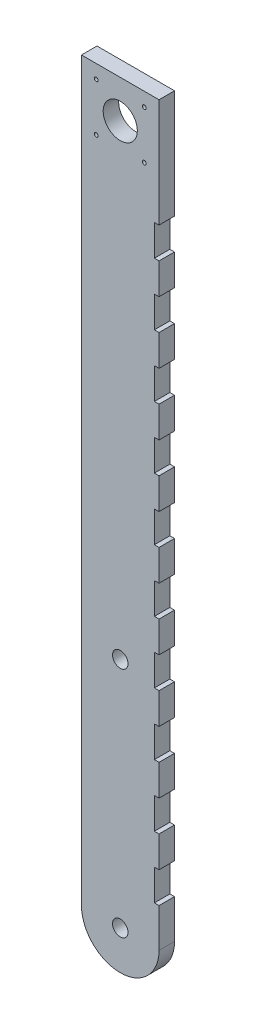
ISO-10303-21;
HEADER;
FILE_DESCRIPTION(('STEP AP214'),'2;1');
FILE_NAME('part.step','',(''),(''),'','','');
FILE_SCHEMA(('AUTOMOTIVE_DESIGN { 1 0 10303 214 1 1 1 1 }'));
ENDSEC;
DATA;
#1=APPLICATION_CONTEXT('core data for automotive mechanical design processes');
#2=APPLICATION_PROTOCOL_DEFINITION('international standard','automotive_design',2000,#1);
#3=PRODUCT_CONTEXT('',#1,'mechanical');
#4=PRODUCT('Part','Part','',(#3));
#5=PRODUCT_RELATED_PRODUCT_CATEGORY('part','',(#4));
#6=PRODUCT_DEFINITION_FORMATION('','',#4);
#7=PRODUCT_DEFINITION_CONTEXT('part definition',#1,'design');
#8=PRODUCT_DEFINITION('design','',#6,#7);
#9=PRODUCT_DEFINITION_SHAPE('','',#8);
#10=(LENGTH_UNIT() NAMED_UNIT(*) SI_UNIT(.MILLI.,.METRE.));
#11=(NAMED_UNIT(*) PLANE_ANGLE_UNIT() SI_UNIT($,.RADIAN.));
#12=(NAMED_UNIT(*) SI_UNIT($,.STERADIAN.) SOLID_ANGLE_UNIT());
#13=UNCERTAINTY_MEASURE_WITH_UNIT(LENGTH_MEASURE(1.E-05),#10,'distance_accuracy_value','');
#14=(GEOMETRIC_REPRESENTATION_CONTEXT(3) GLOBAL_UNCERTAINTY_ASSIGNED_CONTEXT((#13)) GLOBAL_UNIT_ASSIGNED_CONTEXT((#10,
#11,#12)) REPRESENTATION_CONTEXT('',''));
#15=CARTESIAN_POINT('',(0.,0.,0.));
#16=DIRECTION('',(0.,0.,1.));
#17=DIRECTION('',(1.,0.,0.));
#18=AXIS2_PLACEMENT_3D('',#15,#16,#17);
#19=CARTESIAN_POINT('',(0.,-345.,10.));
#20=DIRECTION('',(0.,0.,1.));
#21=DIRECTION('',(1.,0.,0.));
#22=AXIS2_PLACEMENT_3D('',#19,#20,#21);
#23=PLANE('',#22);
#24=CARTESIAN_POINT('',(5.46489483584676E-12,-195.,10.));
#25=DIRECTION('',(0.,0.,1.));
#26=DIRECTION('',(1.,0.,0.));
#27=AXIS2_PLACEMENT_3D('',#24,#25,#26);
#28=CIRCLE('',#27,5.);
#29=CARTESIAN_POINT('',(5.00000000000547,-195.,10.));
#30=VERTEX_POINT('',#29);
#31=EDGE_CURVE('E719',#30,#30,#28,.T.);
#32=ORIENTED_EDGE('',*,*,#31,.F.);
#33=EDGE_LOOP('',(#32));
#34=FACE_BOUND('',#33,.T.);
#35=CARTESIAN_POINT('',(-15.4999999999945,90.1639203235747,10.));
#36=DIRECTION('',(0.,0.,1.));
#37=DIRECTION('',(-1.,0.,0.));
#38=AXIS2_PLACEMENT_3D('',#35,#36,#37);
#39=CIRCLE('',#38,1.25);
#40=CARTESIAN_POINT('',(-16.7499999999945,90.1639203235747,10.));
#41=VERTEX_POINT('',#40);
#42=EDGE_CURVE('E731',#41,#41,#39,.T.);
#43=ORIENTED_EDGE('',*,*,#42,.F.);
#44=EDGE_LOOP('',(#43));
#45=FACE_BOUND('',#44,.T.);
#46=CARTESIAN_POINT('',(15.5000000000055,121.163920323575,10.));
#47=DIRECTION('',(0.,0.,1.));
#48=DIRECTION('',(-1.,0.,0.));
#49=AXIS2_PLACEMENT_3D('',#46,#47,#48);
#50=CIRCLE('',#49,1.25);
#51=CARTESIAN_POINT('',(14.2500000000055,121.163920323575,10.));
#52=VERTEX_POINT('',#51);
#53=EDGE_CURVE('E743',#52,#52,#50,.T.);
#54=ORIENTED_EDGE('',*,*,#53,.F.);
#55=EDGE_LOOP('',(#54));
#56=FACE_BOUND('',#55,.T.);
#57=DIRECTION('',(0.,-1.,0.));
#58=VECTOR('',#57,1.);
#59=CARTESIAN_POINT('',(-25.0000000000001,130.,10.));
#60=LINE('',#59,#58);
#61=CARTESIAN_POINT('',(-25.0000000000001,130.,10.));
#62=VERTEX_POINT('',#61);
#63=CARTESIAN_POINT('',(-24.9999999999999,-345.,10.));
#64=VERTEX_POINT('',#63);
#65=EDGE_CURVE('E433',#62,#64,#60,.T.);
#66=ORIENTED_EDGE('',*,*,#65,.T.);
#67=CARTESIAN_POINT('',(0.,-345.,10.));
#68=DIRECTION('',(0.,0.,1.));
#69=DIRECTION('',(1.,0.,0.));
#70=AXIS2_PLACEMENT_3D('',#67,#68,#69);
#71=CIRCLE('',#70,25.);
#72=CARTESIAN_POINT('',(25.0000000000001,-345.,10.));
#73=VERTEX_POINT('',#72);
#74=EDGE_CURVE('E201',#64,#73,#71,.T.);
#75=ORIENTED_EDGE('',*,*,#74,.T.);
#76=DIRECTION('',(0.,1.,0.));
#77=VECTOR('',#76,1.);
#78=CARTESIAN_POINT('',(25.0000000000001,-345.,10.));
#79=LINE('',#78,#77);
#80=CARTESIAN_POINT('',(25.0000000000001,-320.,10.));
#81=VERTEX_POINT('',#80);
#82=EDGE_CURVE('E556',#73,#81,#79,.T.);
#83=ORIENTED_EDGE('',*,*,#82,.T.);
#84=DIRECTION('',(-1.,0.,0.));
#85=VECTOR('',#84,1.);
#86=CARTESIAN_POINT('',(25.0000000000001,-320.,10.));
#87=LINE('',#86,#85);
#88=CARTESIAN_POINT('',(22.0000000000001,-320.,10.));
#89=VERTEX_POINT('',#88);
#90=EDGE_CURVE('E575',#81,#89,#87,.T.);
#91=ORIENTED_EDGE('',*,*,#90,.T.);
#92=DIRECTION('',(0.,1.,0.));
#93=VECTOR('',#92,1.);
#94=CARTESIAN_POINT('',(22.0000000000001,-320.,10.));
#95=LINE('',#94,#93);
#96=CARTESIAN_POINT('',(22.0000000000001,-300.,10.));
#97=VERTEX_POINT('',#96);
#98=EDGE_CURVE('E572',#89,#97,#95,.T.);
#99=ORIENTED_EDGE('',*,*,#98,.T.);
#100=DIRECTION('',(1.,0.,0.));
#101=VECTOR('',#100,1.);
#102=CARTESIAN_POINT('',(22.0000000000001,-300.,10.));
#103=LINE('',#102,#101);
#104=CARTESIAN_POINT('',(25.0000000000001,-300.,10.));
#105=VERTEX_POINT('',#104);
#106=EDGE_CURVE('E574',#97,#105,#103,.T.);
#107=ORIENTED_EDGE('',*,*,#106,.T.);
#108=DIRECTION('',(0.,1.,0.));
#109=VECTOR('',#108,1.);
#110=CARTESIAN_POINT('',(25.0000000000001,-300.,10.));
#111=LINE('',#110,#109);
#112=CARTESIAN_POINT('',(25.0000000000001,-280.,10.));
#113=VERTEX_POINT('',#112);
#114=EDGE_CURVE('E577',#105,#113,#111,.T.);
#115=ORIENTED_EDGE('',*,*,#114,.T.);
#116=DIRECTION('',(-1.,0.,0.));
#117=VECTOR('',#116,1.);
#118=CARTESIAN_POINT('',(25.0000000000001,-280.,10.));
#119=LINE('',#118,#117);
#120=CARTESIAN_POINT('',(22.0000000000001,-280.,10.));
#121=VERTEX_POINT('',#120);
#122=EDGE_CURVE('E583',#113,#121,#119,.T.);
#123=ORIENTED_EDGE('',*,*,#122,.T.);
#124=DIRECTION('',(0.,1.,0.));
#125=VECTOR('',#124,1.);
#126=CARTESIAN_POINT('',(22.0000000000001,-280.,10.));
#127=LINE('',#126,#125);
#128=CARTESIAN_POINT('',(21.9999999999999,-260.,10.));
#129=VERTEX_POINT('',#128);
#130=EDGE_CURVE('E585',#121,#129,#127,.T.);
#131=ORIENTED_EDGE('',*,*,#130,.T.);
#132=DIRECTION('',(1.,0.,0.));
#133=VECTOR('',#132,1.);
#134=CARTESIAN_POINT('',(21.9999999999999,-260.,10.));
#135=LINE('',#134,#133);
#136=CARTESIAN_POINT('',(24.9999999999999,-260.,10.));
#137=VERTEX_POINT('',#136);
#138=EDGE_CURVE('E587',#129,#137,#135,.T.);
#139=ORIENTED_EDGE('',*,*,#138,.T.);
#140=DIRECTION('',(0.,1.,0.));
#141=VECTOR('',#140,1.);
#142=CARTESIAN_POINT('',(24.9999999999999,-260.,10.));
#143=LINE('',#142,#141);
#144=CARTESIAN_POINT('',(24.9999999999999,-240.,10.));
#145=VERTEX_POINT('',#144);
#146=EDGE_CURVE('E589',#137,#145,#143,.T.);
#147=ORIENTED_EDGE('',*,*,#146,.T.);
#148=DIRECTION('',(-1.,0.,0.));
#149=VECTOR('',#148,1.);
#150=CARTESIAN_POINT('',(24.9999999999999,-240.,10.));
#151=LINE('',#150,#149);
#152=CARTESIAN_POINT('',(21.9999999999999,-240.,10.));
#153=VERTEX_POINT('',#152);
#154=EDGE_CURVE('E591',#145,#153,#151,.T.);
#155=ORIENTED_EDGE('',*,*,#154,.T.);
#156=DIRECTION('',(0.,1.,0.));
#157=VECTOR('',#156,1.);
#158=CARTESIAN_POINT('',(21.9999999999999,-240.,10.));
#159=LINE('',#158,#157);
#160=CARTESIAN_POINT('',(21.9999999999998,-220.,10.));
#161=VERTEX_POINT('',#160);
#162=EDGE_CURVE('E593',#153,#161,#159,.T.);
#163=ORIENTED_EDGE('',*,*,#162,.T.);
#164=DIRECTION('',(1.,0.,0.));
#165=VECTOR('',#164,1.);
#166=CARTESIAN_POINT('',(21.9999999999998,-220.,10.));
#167=LINE('',#166,#165);
#168=CARTESIAN_POINT('',(24.9999999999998,-220.,10.));
#169=VERTEX_POINT('',#168);
#170=EDGE_CURVE('E595',#161,#169,#167,.T.);
#171=ORIENTED_EDGE('',*,*,#170,.T.);
#172=DIRECTION('',(0.,1.,0.));
#173=VECTOR('',#172,1.);
#174=CARTESIAN_POINT('',(24.9999999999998,-220.,10.));
#175=LINE('',#174,#173);
#176=CARTESIAN_POINT('',(24.9999999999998,-200.,10.));
#177=VERTEX_POINT('',#176);
#178=EDGE_CURVE('E597',#169,#177,#175,.T.);
#179=ORIENTED_EDGE('',*,*,#178,.T.);
#180=DIRECTION('',(-1.,0.,0.));
#181=VECTOR('',#180,1.);
#182=CARTESIAN_POINT('',(24.9999999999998,-200.,10.));
#183=LINE('',#182,#181);
#184=CARTESIAN_POINT('',(21.9999999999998,-200.,10.));
#185=VERTEX_POINT('',#184);
#186=EDGE_CURVE('E599',#177,#185,#183,.T.);
#187=ORIENTED_EDGE('',*,*,#186,.T.);
#188=DIRECTION('',(0.,1.,0.));
#189=VECTOR('',#188,1.);
#190=CARTESIAN_POINT('',(21.9999999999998,-200.,10.));
#191=LINE('',#190,#189);
#192=CARTESIAN_POINT('',(21.9999999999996,-180.,10.));
#193=VERTEX_POINT('',#192);
#194=EDGE_CURVE('E601',#185,#193,#191,.T.);
#195=ORIENTED_EDGE('',*,*,#194,.T.);
#196=DIRECTION('',(1.,0.,0.));
#197=VECTOR('',#196,1.);
#198=CARTESIAN_POINT('',(21.9999999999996,-180.,10.));
#199=LINE('',#198,#197);
#200=CARTESIAN_POINT('',(24.9999999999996,-180.,10.));
#201=VERTEX_POINT('',#200);
#202=EDGE_CURVE('E603',#193,#201,#199,.T.);
#203=ORIENTED_EDGE('',*,*,#202,.T.);
#204=DIRECTION('',(0.,1.,0.));
#205=VECTOR('',#204,1.);
#206=CARTESIAN_POINT('',(24.9999999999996,-180.,10.));
#207=LINE('',#206,#205);
#208=CARTESIAN_POINT('',(24.9999999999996,-160.,10.));
#209=VERTEX_POINT('',#208);
#210=EDGE_CURVE('E605',#201,#209,#207,.T.);
#211=ORIENTED_EDGE('',*,*,#210,.T.);
#212=DIRECTION('',(-1.,0.,0.));
#213=VECTOR('',#212,1.);
#214=CARTESIAN_POINT('',(24.9999999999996,-160.,10.));
#215=LINE('',#214,#213);
#216=CARTESIAN_POINT('',(21.9999999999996,-160.,10.));
#217=VERTEX_POINT('',#216);
#218=EDGE_CURVE('E607',#209,#217,#215,.T.);
#219=ORIENTED_EDGE('',*,*,#218,.T.);
#220=DIRECTION('',(0.,1.,0.));
#221=VECTOR('',#220,1.);
#222=CARTESIAN_POINT('',(21.9999999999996,-160.,10.));
#223=LINE('',#222,#221);
#224=CARTESIAN_POINT('',(21.9999999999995,-140.,10.));
#225=VERTEX_POINT('',#224);
#226=EDGE_CURVE('E609',#217,#225,#223,.T.);
#227=ORIENTED_EDGE('',*,*,#226,.T.);
#228=DIRECTION('',(1.,0.,0.));
#229=VECTOR('',#228,1.);
#230=CARTESIAN_POINT('',(21.9999999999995,-140.,10.));
#231=LINE('',#230,#229);
#232=CARTESIAN_POINT('',(24.9999999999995,-140.,10.));
#233=VERTEX_POINT('',#232);
#234=EDGE_CURVE('E611',#225,#233,#231,.T.);
#235=ORIENTED_EDGE('',*,*,#234,.T.);
#236=DIRECTION('',(0.,1.,0.));
#237=VECTOR('',#236,1.);
#238=CARTESIAN_POINT('',(24.9999999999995,-140.,10.));
#239=LINE('',#238,#237);
#240=CARTESIAN_POINT('',(24.9999999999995,-120.,10.));
#241=VERTEX_POINT('',#240);
#242=EDGE_CURVE('E613',#233,#241,#239,.T.);
#243=ORIENTED_EDGE('',*,*,#242,.T.);
#244=DIRECTION('',(-1.,0.,0.));
#245=VECTOR('',#244,1.);
#246=CARTESIAN_POINT('',(24.9999999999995,-120.,10.));
#247=LINE('',#246,#245);
#248=CARTESIAN_POINT('',(21.9999999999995,-120.,10.));
#249=VERTEX_POINT('',#248);
#250=EDGE_CURVE('E615',#241,#249,#247,.T.);
#251=ORIENTED_EDGE('',*,*,#250,.T.);
#252=DIRECTION('',(0.,1.,0.));
#253=VECTOR('',#252,1.);
#254=CARTESIAN_POINT('',(21.9999999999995,-120.,10.));
#255=LINE('',#254,#253);
#256=CARTESIAN_POINT('',(21.9999999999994,-99.9999999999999,10.));
#257=VERTEX_POINT('',#256);
#258=EDGE_CURVE('E617',#249,#257,#255,.T.);
#259=ORIENTED_EDGE('',*,*,#258,.T.);
#260=DIRECTION('',(1.,0.,0.));
#261=VECTOR('',#260,1.);
#262=CARTESIAN_POINT('',(21.9999999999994,-99.9999999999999,10.));
#263=LINE('',#262,#261);
#264=CARTESIAN_POINT('',(24.9999999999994,-99.9999999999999,10.));
#265=VERTEX_POINT('',#264);
#266=EDGE_CURVE('E619',#257,#265,#263,.T.);
#267=ORIENTED_EDGE('',*,*,#266,.T.);
#268=DIRECTION('',(0.,1.,0.));
#269=VECTOR('',#268,1.);
#270=CARTESIAN_POINT('',(24.9999999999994,-99.9999999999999,10.));
#271=LINE('',#270,#269);
#272=CARTESIAN_POINT('',(24.9999999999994,-79.9999999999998,10.));
#273=VERTEX_POINT('',#272);
#274=EDGE_CURVE('E621',#265,#273,#271,.T.);
#275=ORIENTED_EDGE('',*,*,#274,.T.);
#276=DIRECTION('',(-1.,0.,0.));
#277=VECTOR('',#276,1.);
#278=CARTESIAN_POINT('',(24.9999999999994,-79.9999999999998,10.));
#279=LINE('',#278,#277);
#280=CARTESIAN_POINT('',(21.9999999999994,-79.9999999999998,10.));
#281=VERTEX_POINT('',#280);
#282=EDGE_CURVE('E623',#273,#281,#279,.T.);
#283=ORIENTED_EDGE('',*,*,#282,.T.);
#284=DIRECTION('',(0.,1.,0.));
#285=VECTOR('',#284,1.);
#286=CARTESIAN_POINT('',(21.9999999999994,-79.9999999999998,10.));
#287=LINE('',#286,#285);
#288=CARTESIAN_POINT('',(21.9999999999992,-59.9999999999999,10.));
#289=VERTEX_POINT('',#288);
#290=EDGE_CURVE('E625',#281,#289,#287,.T.);
#291=ORIENTED_EDGE('',*,*,#290,.T.);
#292=DIRECTION('',(1.,0.,0.));
#293=VECTOR('',#292,1.);
#294=CARTESIAN_POINT('',(21.9999999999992,-59.9999999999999,10.));
#295=LINE('',#294,#293);
#296=CARTESIAN_POINT('',(24.9999999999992,-59.9999999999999,10.));
#297=VERTEX_POINT('',#296);
#298=EDGE_CURVE('E627',#289,#297,#295,.T.);
#299=ORIENTED_EDGE('',*,*,#298,.T.);
#300=DIRECTION('',(0.,1.,0.));
#301=VECTOR('',#300,1.);
#302=CARTESIAN_POINT('',(24.9999999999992,-59.9999999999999,10.));
#303=LINE('',#302,#301);
#304=CARTESIAN_POINT('',(24.9999999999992,-39.9999999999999,10.));
#305=VERTEX_POINT('',#304);
#306=EDGE_CURVE('E629',#297,#305,#303,.T.);
#307=ORIENTED_EDGE('',*,*,#306,.T.);
#308=DIRECTION('',(-1.,0.,0.));
#309=VECTOR('',#308,1.);
#310=CARTESIAN_POINT('',(24.9999999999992,-39.9999999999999,10.));
#311=LINE('',#310,#309);
#312=CARTESIAN_POINT('',(21.9999999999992,-39.9999999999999,10.));
#313=VERTEX_POINT('',#312);
#314=EDGE_CURVE('E631',#305,#313,#311,.T.);
#315=ORIENTED_EDGE('',*,*,#314,.T.);
#316=DIRECTION('',(0.,1.,0.));
#317=VECTOR('',#316,1.);
#318=CARTESIAN_POINT('',(21.9999999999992,-39.9999999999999,10.));
#319=LINE('',#318,#317);
#320=CARTESIAN_POINT('',(21.9999999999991,-19.9999999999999,10.));
#321=VERTEX_POINT('',#320);
#322=EDGE_CURVE('E633',#313,#321,#319,.T.);
#323=ORIENTED_EDGE('',*,*,#322,.T.);
#324=DIRECTION('',(1.,0.,0.));
#325=VECTOR('',#324,1.);
#326=CARTESIAN_POINT('',(21.9999999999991,-19.9999999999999,10.));
#327=LINE('',#326,#325);
#328=CARTESIAN_POINT('',(24.9999999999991,-19.9999999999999,10.));
#329=VERTEX_POINT('',#328);
#330=EDGE_CURVE('E635',#321,#329,#327,.T.);
#331=ORIENTED_EDGE('',*,*,#330,.T.);
#332=DIRECTION('',(0.,1.,0.));
#333=VECTOR('',#332,1.);
#334=CARTESIAN_POINT('',(24.9999999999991,-19.9999999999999,10.));
#335=LINE('',#334,#333);
#336=CARTESIAN_POINT('',(24.9999999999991,1.66533453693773E-13,10.));
#337=VERTEX_POINT('',#336);
#338=EDGE_CURVE('E637',#329,#337,#335,.T.);
#339=ORIENTED_EDGE('',*,*,#338,.T.);
#340=DIRECTION('',(-1.,0.,0.));
#341=VECTOR('',#340,1.);
#342=CARTESIAN_POINT('',(24.9999999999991,1.66533453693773E-13,10.));
#343=LINE('',#342,#341);
#344=CARTESIAN_POINT('',(21.9999999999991,1.66533453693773E-13,10.));
#345=VERTEX_POINT('',#344);
#346=EDGE_CURVE('E639',#337,#345,#343,.T.);
#347=ORIENTED_EDGE('',*,*,#346,.T.);
#348=DIRECTION('',(0.,1.,0.));
#349=VECTOR('',#348,1.);
#350=CARTESIAN_POINT('',(21.9999999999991,1.66533453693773E-13,10.));
#351=LINE('',#350,#349);
#352=CARTESIAN_POINT('',(21.9999999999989,20.0000000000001,10.));
#353=VERTEX_POINT('',#352);
#354=EDGE_CURVE('E641',#345,#353,#351,.T.);
#355=ORIENTED_EDGE('',*,*,#354,.T.);
#356=DIRECTION('',(1.,0.,0.));
#357=VECTOR('',#356,1.);
#358=CARTESIAN_POINT('',(21.9999999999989,20.0000000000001,10.));
#359=LINE('',#358,#357);
#360=CARTESIAN_POINT('',(24.9999999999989,20.0000000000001,10.));
#361=VERTEX_POINT('',#360);
#362=EDGE_CURVE('E643',#353,#361,#359,.T.);
#363=ORIENTED_EDGE('',*,*,#362,.T.);
#364=DIRECTION('',(0.,1.,0.));
#365=VECTOR('',#364,1.);
#366=CARTESIAN_POINT('',(24.9999999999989,20.0000000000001,10.));
#367=LINE('',#366,#365);
#368=CARTESIAN_POINT('',(24.9999999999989,40.0000000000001,10.));
#369=VERTEX_POINT('',#368);
#370=EDGE_CURVE('E645',#361,#369,#367,.T.);
#371=ORIENTED_EDGE('',*,*,#370,.T.);
#372=DIRECTION('',(-1.,0.,0.));
#373=VECTOR('',#372,1.);
#374=CARTESIAN_POINT('',(24.9999999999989,40.0000000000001,10.));
#375=LINE('',#374,#373);
#376=CARTESIAN_POINT('',(21.9999999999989,40.0000000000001,10.));
#377=VERTEX_POINT('',#376);
#378=EDGE_CURVE('E647',#369,#377,#375,.T.);
#379=ORIENTED_EDGE('',*,*,#378,.T.);
#380=DIRECTION('',(0.,1.,0.));
#381=VECTOR('',#380,1.);
#382=CARTESIAN_POINT('',(21.9999999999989,40.0000000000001,10.));
#383=LINE('',#382,#381);
#384=CARTESIAN_POINT('',(21.9999999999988,60.0000000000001,10.));
#385=VERTEX_POINT('',#384);
#386=EDGE_CURVE('E328',#377,#385,#383,.T.);
#387=ORIENTED_EDGE('',*,*,#386,.T.);
#388=DIRECTION('',(1.,0.,0.));
#389=VECTOR('',#388,1.);
#390=CARTESIAN_POINT('',(21.9999999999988,60.0000000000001,10.));
#391=LINE('',#390,#389);
#392=CARTESIAN_POINT('',(24.9999999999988,60.0000000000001,10.));
#393=VERTEX_POINT('',#392);
#394=EDGE_CURVE('E322',#385,#393,#391,.T.);
#395=ORIENTED_EDGE('',*,*,#394,.T.);
#396=DIRECTION('',(0.,1.,0.));
#397=VECTOR('',#396,1.);
#398=CARTESIAN_POINT('',(24.9999999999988,60.0000000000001,10.));
#399=LINE('',#398,#397);
#400=CARTESIAN_POINT('',(24.9999999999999,130.,10.));
#401=VERTEX_POINT('',#400);
#402=EDGE_CURVE('E326',#393,#401,#399,.T.);
#403=ORIENTED_EDGE('',*,*,#402,.T.);
#404=DIRECTION('',(-1.,0.,0.));
#405=VECTOR('',#404,1.);
#406=CARTESIAN_POINT('',(-25.0000000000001,130.,10.));
#407=LINE('',#406,#405);
#408=EDGE_CURVE('E50',#401,#62,#407,.T.);
#409=ORIENTED_EDGE('',*,*,#408,.T.);
#410=EDGE_LOOP('',(#66,#75,#83,#91,#99,#107,#115,#123,#131,#139,#147,#155,#163,#171,#179,#187,
#195,#203,#211,#219,#227,#235,#243,#251,#259,#267,#275,#283,#291,#299,#307,#315,#323,#331,#339,
#347,#355,#363,#371,#379,#387,#395,#403,#409));
#411=FACE_BOUND('',#410,.T.);
#412=CARTESIAN_POINT('',(-15.4999999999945,121.163920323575,10.));
#413=DIRECTION('',(0.,0.,1.));
#414=DIRECTION('',(1.,0.,0.));
#415=AXIS2_PLACEMENT_3D('',#412,#413,#414);
#416=CIRCLE('',#415,1.25);
#417=CARTESIAN_POINT('',(-14.2499999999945,121.163920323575,10.));
#418=VERTEX_POINT('',#417);
#419=EDGE_CURVE('E350',#418,#418,#416,.T.);
#420=ORIENTED_EDGE('',*,*,#419,.F.);
#421=EDGE_LOOP('',(#420));
#422=FACE_BOUND('',#421,.T.);
#423=CARTESIAN_POINT('',(15.5000000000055,90.1639203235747,10.));
#424=DIRECTION('',(0.,0.,1.));
#425=DIRECTION('',(1.,0.,0.));
#426=AXIS2_PLACEMENT_3D('',#423,#424,#425);
#427=CIRCLE('',#426,1.25);
#428=CARTESIAN_POINT('',(16.7500000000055,90.1639203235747,10.));
#429=VERTEX_POINT('',#428);
#430=EDGE_CURVE('E737',#429,#429,#427,.T.);
#431=ORIENTED_EDGE('',*,*,#430,.F.);
#432=EDGE_LOOP('',(#431));
#433=FACE_BOUND('',#432,.T.);
#434=CARTESIAN_POINT('',(5.4678483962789E-12,105.663920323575,10.));
#435=DIRECTION('',(0.,0.,1.));
#436=DIRECTION('',(1.,0.,0.));
#437=AXIS2_PLACEMENT_3D('',#434,#435,#436);
#438=CIRCLE('',#437,11.);
#439=CARTESIAN_POINT('',(11.0000000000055,105.663920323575,10.));
#440=VERTEX_POINT('',#439);
#441=EDGE_CURVE('E725',#440,#440,#438,.T.);
#442=ORIENTED_EDGE('',*,*,#441,.F.);
#443=EDGE_LOOP('',(#442));
#444=FACE_BOUND('',#443,.T.);
#445=CARTESIAN_POINT('',(0.,-345.,10.));
#446=DIRECTION('',(0.,0.,1.));
#447=DIRECTION('',(1.,0.,0.));
#448=AXIS2_PLACEMENT_3D('',#445,#446,#447);
#449=CIRCLE('',#448,5.);
#450=CARTESIAN_POINT('',(5.00000000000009,-345.,10.));
#451=VERTEX_POINT('',#450);
#452=EDGE_CURVE('E710',#451,#451,#449,.T.);
#453=ORIENTED_EDGE('',*,*,#452,.F.);
#454=EDGE_LOOP('',(#453));
#455=FACE_BOUND('',#454,.T.);
#456=ADVANCED_FACE('F33',(#34,#45,#56,#411,#422,#433,#444,#455),#23,.T.);
#457=CARTESIAN_POINT('',(0.,-345.,0.));
#458=DIRECTION('',(0.,0.,1.));
#459=DIRECTION('',(1.,0.,0.));
#460=AXIS2_PLACEMENT_3D('',#457,#458,#459);
#461=PLANE('',#460);
#462=DIRECTION('',(0.,-1.,0.));
#463=VECTOR('',#462,1.);
#464=CARTESIAN_POINT('',(-25.0000000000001,130.,0.));
#465=LINE('',#464,#463);
#466=CARTESIAN_POINT('',(-25.0000000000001,130.,0.));
#467=VERTEX_POINT('',#466);
#468=CARTESIAN_POINT('',(-24.9999999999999,-345.,0.));
#469=VERTEX_POINT('',#468);
#470=EDGE_CURVE('E346',#467,#469,#465,.T.);
#471=ORIENTED_EDGE('',*,*,#470,.F.);
#472=DIRECTION('',(-1.,0.,0.));
#473=VECTOR('',#472,1.);
#474=CARTESIAN_POINT('',(-25.0000000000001,130.,0.));
#475=LINE('',#474,#473);
#476=CARTESIAN_POINT('',(24.9999999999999,130.,0.));
#477=VERTEX_POINT('',#476);
#478=EDGE_CURVE('E193',#477,#467,#475,.T.);
#479=ORIENTED_EDGE('',*,*,#478,.F.);
#480=DIRECTION('',(0.,1.,0.));
#481=VECTOR('',#480,1.);
#482=CARTESIAN_POINT('',(24.9999999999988,60.0000000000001,0.));
#483=LINE('',#482,#481);
#484=CARTESIAN_POINT('',(24.9999999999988,60.0000000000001,0.));
#485=VERTEX_POINT('',#484);
#486=EDGE_CURVE('E187',#485,#477,#483,.T.);
#487=ORIENTED_EDGE('',*,*,#486,.F.);
#488=DIRECTION('',(1.,0.,0.));
#489=VECTOR('',#488,1.);
#490=CARTESIAN_POINT('',(21.9999999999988,60.0000000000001,0.));
#491=LINE('',#490,#489);
#492=CARTESIAN_POINT('',(21.9999999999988,60.0000000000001,0.));
#493=VERTEX_POINT('',#492);
#494=EDGE_CURVE('E336',#493,#485,#491,.T.);
#495=ORIENTED_EDGE('',*,*,#494,.F.);
#496=DIRECTION('',(0.,1.,0.));
#497=VECTOR('',#496,1.);
#498=CARTESIAN_POINT('',(21.9999999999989,40.0000000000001,0.));
#499=LINE('',#498,#497);
#500=CARTESIAN_POINT('',(21.9999999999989,40.0000000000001,0.));
#501=VERTEX_POINT('',#500);
#502=EDGE_CURVE('E428',#501,#493,#499,.T.);
#503=ORIENTED_EDGE('',*,*,#502,.F.);
#504=DIRECTION('',(-1.,0.,0.));
#505=VECTOR('',#504,1.);
#506=CARTESIAN_POINT('',(24.9999999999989,40.0000000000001,0.));
#507=LINE('',#506,#505);
#508=CARTESIAN_POINT('',(24.9999999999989,40.0000000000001,0.));
#509=VERTEX_POINT('',#508);
#510=EDGE_CURVE('E426',#509,#501,#507,.T.);
#511=ORIENTED_EDGE('',*,*,#510,.F.);
#512=DIRECTION('',(0.,1.,0.));
#513=VECTOR('',#512,1.);
#514=CARTESIAN_POINT('',(24.9999999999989,20.0000000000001,0.));
#515=LINE('',#514,#513);
#516=CARTESIAN_POINT('',(24.9999999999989,20.0000000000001,0.));
#517=VERTEX_POINT('',#516);
#518=EDGE_CURVE('E424',#517,#509,#515,.T.);
#519=ORIENTED_EDGE('',*,*,#518,.F.);
#520=DIRECTION('',(1.,0.,0.));
#521=VECTOR('',#520,1.);
#522=CARTESIAN_POINT('',(21.9999999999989,20.0000000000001,0.));
#523=LINE('',#522,#521);
#524=CARTESIAN_POINT('',(21.9999999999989,20.0000000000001,0.));
#525=VERTEX_POINT('',#524);
#526=EDGE_CURVE('E422',#525,#517,#523,.T.);
#527=ORIENTED_EDGE('',*,*,#526,.F.);
#528=DIRECTION('',(0.,1.,0.));
#529=VECTOR('',#528,1.);
#530=CARTESIAN_POINT('',(21.9999999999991,1.66533453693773E-13,0.));
#531=LINE('',#530,#529);
#532=CARTESIAN_POINT('',(21.9999999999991,1.66533453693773E-13,0.));
#533=VERTEX_POINT('',#532);
#534=EDGE_CURVE('E420',#533,#525,#531,.T.);
#535=ORIENTED_EDGE('',*,*,#534,.F.);
#536=DIRECTION('',(-1.,0.,0.));
#537=VECTOR('',#536,1.);
#538=CARTESIAN_POINT('',(24.9999999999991,1.66533453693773E-13,0.));
#539=LINE('',#538,#537);
#540=CARTESIAN_POINT('',(24.9999999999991,1.66533453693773E-13,0.));
#541=VERTEX_POINT('',#540);
#542=EDGE_CURVE('E418',#541,#533,#539,.T.);
#543=ORIENTED_EDGE('',*,*,#542,.F.);
#544=DIRECTION('',(0.,1.,0.));
#545=VECTOR('',#544,1.);
#546=CARTESIAN_POINT('',(24.9999999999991,-19.9999999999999,0.));
#547=LINE('',#546,#545);
#548=CARTESIAN_POINT('',(24.9999999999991,-19.9999999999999,0.));
#549=VERTEX_POINT('',#548);
#550=EDGE_CURVE('E416',#549,#541,#547,.T.);
#551=ORIENTED_EDGE('',*,*,#550,.F.);
#552=DIRECTION('',(1.,0.,0.));
#553=VECTOR('',#552,1.);
#554=CARTESIAN_POINT('',(21.9999999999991,-19.9999999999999,0.));
#555=LINE('',#554,#553);
#556=CARTESIAN_POINT('',(21.9999999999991,-19.9999999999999,0.));
#557=VERTEX_POINT('',#556);
#558=EDGE_CURVE('E414',#557,#549,#555,.T.);
#559=ORIENTED_EDGE('',*,*,#558,.F.);
#560=DIRECTION('',(0.,1.,0.));
#561=VECTOR('',#560,1.);
#562=CARTESIAN_POINT('',(21.9999999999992,-39.9999999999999,0.));
#563=LINE('',#562,#561);
#564=CARTESIAN_POINT('',(21.9999999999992,-39.9999999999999,0.));
#565=VERTEX_POINT('',#564);
#566=EDGE_CURVE('E412',#565,#557,#563,.T.);
#567=ORIENTED_EDGE('',*,*,#566,.F.);
#568=DIRECTION('',(-1.,0.,0.));
#569=VECTOR('',#568,1.);
#570=CARTESIAN_POINT('',(24.9999999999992,-39.9999999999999,0.));
#571=LINE('',#570,#569);
#572=CARTESIAN_POINT('',(24.9999999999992,-39.9999999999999,0.));
#573=VERTEX_POINT('',#572);
#574=EDGE_CURVE('E410',#573,#565,#571,.T.);
#575=ORIENTED_EDGE('',*,*,#574,.F.);
#576=DIRECTION('',(0.,1.,0.));
#577=VECTOR('',#576,1.);
#578=CARTESIAN_POINT('',(24.9999999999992,-59.9999999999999,0.));
#579=LINE('',#578,#577);
#580=CARTESIAN_POINT('',(24.9999999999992,-59.9999999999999,0.));
#581=VERTEX_POINT('',#580);
#582=EDGE_CURVE('E408',#581,#573,#579,.T.);
#583=ORIENTED_EDGE('',*,*,#582,.F.);
#584=DIRECTION('',(1.,0.,0.));
#585=VECTOR('',#584,1.);
#586=CARTESIAN_POINT('',(21.9999999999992,-59.9999999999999,0.));
#587=LINE('',#586,#585);
#588=CARTESIAN_POINT('',(21.9999999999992,-59.9999999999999,0.));
#589=VERTEX_POINT('',#588);
#590=EDGE_CURVE('E406',#589,#581,#587,.T.);
#591=ORIENTED_EDGE('',*,*,#590,.F.);
#592=DIRECTION('',(0.,1.,0.));
#593=VECTOR('',#592,1.);
#594=CARTESIAN_POINT('',(21.9999999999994,-79.9999999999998,0.));
#595=LINE('',#594,#593);
#596=CARTESIAN_POINT('',(21.9999999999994,-79.9999999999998,0.));
#597=VERTEX_POINT('',#596);
#598=EDGE_CURVE('E404',#597,#589,#595,.T.);
#599=ORIENTED_EDGE('',*,*,#598,.F.);
#600=DIRECTION('',(-1.,0.,0.));
#601=VECTOR('',#600,1.);
#602=CARTESIAN_POINT('',(24.9999999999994,-79.9999999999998,0.));
#603=LINE('',#602,#601);
#604=CARTESIAN_POINT('',(24.9999999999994,-79.9999999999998,0.));
#605=VERTEX_POINT('',#604);
#606=EDGE_CURVE('E402',#605,#597,#603,.T.);
#607=ORIENTED_EDGE('',*,*,#606,.F.);
#608=DIRECTION('',(0.,1.,0.));
#609=VECTOR('',#608,1.);
#610=CARTESIAN_POINT('',(24.9999999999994,-99.9999999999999,0.));
#611=LINE('',#610,#609);
#612=CARTESIAN_POINT('',(24.9999999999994,-99.9999999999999,0.));
#613=VERTEX_POINT('',#612);
#614=EDGE_CURVE('E400',#613,#605,#611,.T.);
#615=ORIENTED_EDGE('',*,*,#614,.F.);
#616=DIRECTION('',(1.,0.,0.));
#617=VECTOR('',#616,1.);
#618=CARTESIAN_POINT('',(21.9999999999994,-99.9999999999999,0.));
#619=LINE('',#618,#617);
#620=CARTESIAN_POINT('',(21.9999999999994,-99.9999999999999,0.));
#621=VERTEX_POINT('',#620);
#622=EDGE_CURVE('E398',#621,#613,#619,.T.);
#623=ORIENTED_EDGE('',*,*,#622,.F.);
#624=DIRECTION('',(0.,1.,0.));
#625=VECTOR('',#624,1.);
#626=CARTESIAN_POINT('',(21.9999999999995,-120.,0.));
#627=LINE('',#626,#625);
#628=CARTESIAN_POINT('',(21.9999999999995,-120.,0.));
#629=VERTEX_POINT('',#628);
#630=EDGE_CURVE('E396',#629,#621,#627,.T.);
#631=ORIENTED_EDGE('',*,*,#630,.F.);
#632=DIRECTION('',(-1.,0.,0.));
#633=VECTOR('',#632,1.);
#634=CARTESIAN_POINT('',(24.9999999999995,-120.,0.));
#635=LINE('',#634,#633);
#636=CARTESIAN_POINT('',(24.9999999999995,-120.,0.));
#637=VERTEX_POINT('',#636);
#638=EDGE_CURVE('E394',#637,#629,#635,.T.);
#639=ORIENTED_EDGE('',*,*,#638,.F.);
#640=DIRECTION('',(0.,1.,0.));
#641=VECTOR('',#640,1.);
#642=CARTESIAN_POINT('',(24.9999999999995,-140.,0.));
#643=LINE('',#642,#641);
#644=CARTESIAN_POINT('',(24.9999999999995,-140.,0.));
#645=VERTEX_POINT('',#644);
#646=EDGE_CURVE('E392',#645,#637,#643,.T.);
#647=ORIENTED_EDGE('',*,*,#646,.F.);
#648=DIRECTION('',(1.,0.,0.));
#649=VECTOR('',#648,1.);
#650=CARTESIAN_POINT('',(21.9999999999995,-140.,0.));
#651=LINE('',#650,#649);
#652=CARTESIAN_POINT('',(21.9999999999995,-140.,0.));
#653=VERTEX_POINT('',#652);
#654=EDGE_CURVE('E390',#653,#645,#651,.T.);
#655=ORIENTED_EDGE('',*,*,#654,.F.);
#656=DIRECTION('',(0.,1.,0.));
#657=VECTOR('',#656,1.);
#658=CARTESIAN_POINT('',(21.9999999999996,-160.,0.));
#659=LINE('',#658,#657);
#660=CARTESIAN_POINT('',(21.9999999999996,-160.,0.));
#661=VERTEX_POINT('',#660);
#662=EDGE_CURVE('E388',#661,#653,#659,.T.);
#663=ORIENTED_EDGE('',*,*,#662,.F.);
#664=DIRECTION('',(-1.,0.,0.));
#665=VECTOR('',#664,1.);
#666=CARTESIAN_POINT('',(24.9999999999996,-160.,0.));
#667=LINE('',#666,#665);
#668=CARTESIAN_POINT('',(24.9999999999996,-160.,0.));
#669=VERTEX_POINT('',#668);
#670=EDGE_CURVE('E386',#669,#661,#667,.T.);
#671=ORIENTED_EDGE('',*,*,#670,.F.);
#672=DIRECTION('',(0.,1.,0.));
#673=VECTOR('',#672,1.);
#674=CARTESIAN_POINT('',(24.9999999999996,-180.,0.));
#675=LINE('',#674,#673);
#676=CARTESIAN_POINT('',(24.9999999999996,-180.,0.));
#677=VERTEX_POINT('',#676);
#678=EDGE_CURVE('E384',#677,#669,#675,.T.);
#679=ORIENTED_EDGE('',*,*,#678,.F.);
#680=DIRECTION('',(1.,0.,0.));
#681=VECTOR('',#680,1.);
#682=CARTESIAN_POINT('',(21.9999999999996,-180.,0.));
#683=LINE('',#682,#681);
#684=CARTESIAN_POINT('',(21.9999999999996,-180.,0.));
#685=VERTEX_POINT('',#684);
#686=EDGE_CURVE('E382',#685,#677,#683,.T.);
#687=ORIENTED_EDGE('',*,*,#686,.F.);
#688=DIRECTION('',(0.,1.,0.));
#689=VECTOR('',#688,1.);
#690=CARTESIAN_POINT('',(21.9999999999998,-200.,0.));
#691=LINE('',#690,#689);
#692=CARTESIAN_POINT('',(21.9999999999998,-200.,0.));
#693=VERTEX_POINT('',#692);
#694=EDGE_CURVE('E380',#693,#685,#691,.T.);
#695=ORIENTED_EDGE('',*,*,#694,.F.);
#696=DIRECTION('',(-1.,0.,0.));
#697=VECTOR('',#696,1.);
#698=CARTESIAN_POINT('',(24.9999999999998,-200.,0.));
#699=LINE('',#698,#697);
#700=CARTESIAN_POINT('',(24.9999999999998,-200.,0.));
#701=VERTEX_POINT('',#700);
#702=EDGE_CURVE('E378',#701,#693,#699,.T.);
#703=ORIENTED_EDGE('',*,*,#702,.F.);
#704=DIRECTION('',(0.,1.,0.));
#705=VECTOR('',#704,1.);
#706=CARTESIAN_POINT('',(24.9999999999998,-220.,0.));
#707=LINE('',#706,#705);
#708=CARTESIAN_POINT('',(24.9999999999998,-220.,0.));
#709=VERTEX_POINT('',#708);
#710=EDGE_CURVE('E376',#709,#701,#707,.T.);
#711=ORIENTED_EDGE('',*,*,#710,.F.);
#712=DIRECTION('',(1.,0.,0.));
#713=VECTOR('',#712,1.);
#714=CARTESIAN_POINT('',(21.9999999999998,-220.,0.));
#715=LINE('',#714,#713);
#716=CARTESIAN_POINT('',(21.9999999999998,-220.,0.));
#717=VERTEX_POINT('',#716);
#718=EDGE_CURVE('E374',#717,#709,#715,.T.);
#719=ORIENTED_EDGE('',*,*,#718,.F.);
#720=DIRECTION('',(0.,1.,0.));
#721=VECTOR('',#720,1.);
#722=CARTESIAN_POINT('',(21.9999999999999,-240.,0.));
#723=LINE('',#722,#721);
#724=CARTESIAN_POINT('',(21.9999999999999,-240.,0.));
#725=VERTEX_POINT('',#724);
#726=EDGE_CURVE('E372',#725,#717,#723,.T.);
#727=ORIENTED_EDGE('',*,*,#726,.F.);
#728=DIRECTION('',(-1.,0.,0.));
#729=VECTOR('',#728,1.);
#730=CARTESIAN_POINT('',(24.9999999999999,-240.,0.));
#731=LINE('',#730,#729);
#732=CARTESIAN_POINT('',(24.9999999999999,-240.,0.));
#733=VERTEX_POINT('',#732);
#734=EDGE_CURVE('E370',#733,#725,#731,.T.);
#735=ORIENTED_EDGE('',*,*,#734,.F.);
#736=DIRECTION('',(0.,1.,0.));
#737=VECTOR('',#736,1.);
#738=CARTESIAN_POINT('',(24.9999999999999,-260.,0.));
#739=LINE('',#738,#737);
#740=CARTESIAN_POINT('',(24.9999999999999,-260.,0.));
#741=VERTEX_POINT('',#740);
#742=EDGE_CURVE('E368',#741,#733,#739,.T.);
#743=ORIENTED_EDGE('',*,*,#742,.F.);
#744=DIRECTION('',(1.,0.,0.));
#745=VECTOR('',#744,1.);
#746=CARTESIAN_POINT('',(21.9999999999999,-260.,0.));
#747=LINE('',#746,#745);
#748=CARTESIAN_POINT('',(21.9999999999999,-260.,0.));
#749=VERTEX_POINT('',#748);
#750=EDGE_CURVE('E366',#749,#741,#747,.T.);
#751=ORIENTED_EDGE('',*,*,#750,.F.);
#752=DIRECTION('',(0.,1.,0.));
#753=VECTOR('',#752,1.);
#754=CARTESIAN_POINT('',(22.0000000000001,-280.,0.));
#755=LINE('',#754,#753);
#756=CARTESIAN_POINT('',(22.0000000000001,-280.,0.));
#757=VERTEX_POINT('',#756);
#758=EDGE_CURVE('E364',#757,#749,#755,.T.);
#759=ORIENTED_EDGE('',*,*,#758,.F.);
#760=DIRECTION('',(-1.,0.,0.));
#761=VECTOR('',#760,1.);
#762=CARTESIAN_POINT('',(25.0000000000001,-280.,0.));
#763=LINE('',#762,#761);
#764=CARTESIAN_POINT('',(25.0000000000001,-280.,0.));
#765=VERTEX_POINT('',#764);
#766=EDGE_CURVE('E362',#765,#757,#763,.T.);
#767=ORIENTED_EDGE('',*,*,#766,.F.);
#768=DIRECTION('',(0.,1.,0.));
#769=VECTOR('',#768,1.);
#770=CARTESIAN_POINT('',(25.0000000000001,-300.,0.));
#771=LINE('',#770,#769);
#772=CARTESIAN_POINT('',(25.0000000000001,-300.,0.));
#773=VERTEX_POINT('',#772);
#774=EDGE_CURVE('E360',#773,#765,#771,.T.);
#775=ORIENTED_EDGE('',*,*,#774,.F.);
#776=DIRECTION('',(1.,0.,0.));
#777=VECTOR('',#776,1.);
#778=CARTESIAN_POINT('',(22.0000000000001,-300.,0.));
#779=LINE('',#778,#777);
#780=CARTESIAN_POINT('',(22.0000000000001,-300.,0.));
#781=VERTEX_POINT('',#780);
#782=EDGE_CURVE('E358',#781,#773,#779,.T.);
#783=ORIENTED_EDGE('',*,*,#782,.F.);
#784=DIRECTION('',(0.,1.,0.));
#785=VECTOR('',#784,1.);
#786=CARTESIAN_POINT('',(22.0000000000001,-320.,0.));
#787=LINE('',#786,#785);
#788=CARTESIAN_POINT('',(22.0000000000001,-320.,0.));
#789=VERTEX_POINT('',#788);
#790=EDGE_CURVE('E356',#789,#781,#787,.T.);
#791=ORIENTED_EDGE('',*,*,#790,.F.);
#792=DIRECTION('',(-1.,0.,0.));
#793=VECTOR('',#792,1.);
#794=CARTESIAN_POINT('',(25.0000000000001,-320.,0.));
#795=LINE('',#794,#793);
#796=CARTESIAN_POINT('',(25.0000000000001,-320.,0.));
#797=VERTEX_POINT('',#796);
#798=EDGE_CURVE('E354',#797,#789,#795,.T.);
#799=ORIENTED_EDGE('',*,*,#798,.F.);
#800=DIRECTION('',(0.,1.,0.));
#801=VECTOR('',#800,1.);
#802=CARTESIAN_POINT('',(25.0000000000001,-345.,0.));
#803=LINE('',#802,#801);
#804=CARTESIAN_POINT('',(25.0000000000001,-345.,0.));
#805=VERTEX_POINT('',#804);
#806=EDGE_CURVE('E352',#805,#797,#803,.T.);
#807=ORIENTED_EDGE('',*,*,#806,.F.);
#808=CARTESIAN_POINT('',(0.,-345.,0.));
#809=DIRECTION('',(0.,0.,1.));
#810=DIRECTION('',(1.,0.,0.));
#811=AXIS2_PLACEMENT_3D('',#808,#809,#810);
#812=CIRCLE('',#811,25.);
#813=EDGE_CURVE('E349',#469,#805,#812,.T.);
#814=ORIENTED_EDGE('',*,*,#813,.F.);
#815=EDGE_LOOP('',(#471,#479,#487,#495,#503,#511,#519,#527,#535,#543,#551,#559,#567,#575,#583,
#591,#599,#607,#615,#623,#631,#639,#647,#655,#663,#671,#679,#687,#695,#703,#711,#719,#727,#735,
#743,#751,#759,#767,#775,#783,#791,#799,#807,#814));
#816=FACE_BOUND('',#815,.T.);
#817=CARTESIAN_POINT('',(-15.4999999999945,121.163920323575,0.));
#818=DIRECTION('',(0.,0.,1.));
#819=DIRECTION('',(1.,0.,0.));
#820=AXIS2_PLACEMENT_3D('',#817,#818,#819);
#821=CIRCLE('',#820,1.25);
#822=CARTESIAN_POINT('',(-14.2499999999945,121.163920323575,0.));
#823=VERTEX_POINT('',#822);
#824=EDGE_CURVE('E746',#823,#823,#821,.T.);
#825=ORIENTED_EDGE('',*,*,#824,.T.);
#826=EDGE_LOOP('',(#825));
#827=FACE_BOUND('',#826,.T.);
#828=CARTESIAN_POINT('',(15.5000000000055,121.163920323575,0.));
#829=DIRECTION('',(0.,0.,1.));
#830=DIRECTION('',(-1.,0.,0.));
#831=AXIS2_PLACEMENT_3D('',#828,#829,#830);
#832=CIRCLE('',#831,1.25);
#833=CARTESIAN_POINT('',(14.2500000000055,121.163920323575,0.));
#834=VERTEX_POINT('',#833);
#835=EDGE_CURVE('E740',#834,#834,#832,.T.);
#836=ORIENTED_EDGE('',*,*,#835,.T.);
#837=EDGE_LOOP('',(#836));
#838=FACE_BOUND('',#837,.T.);
#839=CARTESIAN_POINT('',(15.5000000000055,90.1639203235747,0.));
#840=DIRECTION('',(0.,0.,1.));
#841=DIRECTION('',(1.,0.,0.));
#842=AXIS2_PLACEMENT_3D('',#839,#840,#841);
#843=CIRCLE('',#842,1.25);
#844=CARTESIAN_POINT('',(16.7500000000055,90.1639203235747,0.));
#845=VERTEX_POINT('',#844);
#846=EDGE_CURVE('E734',#845,#845,#843,.T.);
#847=ORIENTED_EDGE('',*,*,#846,.T.);
#848=EDGE_LOOP('',(#847));
#849=FACE_BOUND('',#848,.T.);
#850=CARTESIAN_POINT('',(-15.4999999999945,90.1639203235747,0.));
#851=DIRECTION('',(0.,0.,1.));
#852=DIRECTION('',(-1.,0.,0.));
#853=AXIS2_PLACEMENT_3D('',#850,#851,#852);
#854=CIRCLE('',#853,1.25);
#855=CARTESIAN_POINT('',(-16.7499999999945,90.1639203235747,0.));
#856=VERTEX_POINT('',#855);
#857=EDGE_CURVE('E728',#856,#856,#854,.T.);
#858=ORIENTED_EDGE('',*,*,#857,.T.);
#859=EDGE_LOOP('',(#858));
#860=FACE_BOUND('',#859,.T.);
#861=CARTESIAN_POINT('',(5.4678483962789E-12,105.663920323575,0.));
#862=DIRECTION('',(0.,0.,1.));
#863=DIRECTION('',(1.,0.,0.));
#864=AXIS2_PLACEMENT_3D('',#861,#862,#863);
#865=CIRCLE('',#864,11.);
#866=CARTESIAN_POINT('',(11.0000000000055,105.663920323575,0.));
#867=VERTEX_POINT('',#866);
#868=EDGE_CURVE('E722',#867,#867,#865,.T.);
#869=ORIENTED_EDGE('',*,*,#868,.T.);
#870=EDGE_LOOP('',(#869));
#871=FACE_BOUND('',#870,.T.);
#872=CARTESIAN_POINT('',(5.46489483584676E-12,-195.,0.));
#873=DIRECTION('',(0.,0.,1.));
#874=DIRECTION('',(1.,0.,0.));
#875=AXIS2_PLACEMENT_3D('',#872,#873,#874);
#876=CIRCLE('',#875,5.);
#877=CARTESIAN_POINT('',(5.00000000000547,-195.,0.));
#878=VERTEX_POINT('',#877);
#879=EDGE_CURVE('E716',#878,#878,#876,.T.);
#880=ORIENTED_EDGE('',*,*,#879,.T.);
#881=EDGE_LOOP('',(#880));
#882=FACE_BOUND('',#881,.T.);
#883=CARTESIAN_POINT('',(0.,-345.,0.));
#884=DIRECTION('',(0.,0.,1.));
#885=DIRECTION('',(1.,0.,0.));
#886=AXIS2_PLACEMENT_3D('',#883,#884,#885);
#887=CIRCLE('',#886,5.);
#888=CARTESIAN_POINT('',(5.00000000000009,-345.,0.));
#889=VERTEX_POINT('',#888);
#890=EDGE_CURVE('E713',#889,#889,#887,.T.);
#891=ORIENTED_EDGE('',*,*,#890,.T.);
#892=EDGE_LOOP('',(#891));
#893=FACE_BOUND('',#892,.T.);
#894=ADVANCED_FACE('F560',(#816,#827,#838,#849,#860,#871,#882,#893),#461,.F.);
#895=CARTESIAN_POINT('',(-25.0000000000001,130.,10.));
#896=DIRECTION('',(1.,0.,0.));
#897=DIRECTION('',(0.,1.,0.));
#898=AXIS2_PLACEMENT_3D('',#895,#896,#897);
#899=PLANE('',#898);
#900=ORIENTED_EDGE('',*,*,#470,.T.);
#901=DIRECTION('',(0.,0.,-1.));
#902=VECTOR('',#901,1.);
#903=CARTESIAN_POINT('',(-24.9999999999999,-345.,10.));
#904=LINE('',#903,#902);
#905=EDGE_CURVE('E11',#64,#469,#904,.T.);
#906=ORIENTED_EDGE('',*,*,#905,.F.);
#907=ORIENTED_EDGE('',*,*,#65,.F.);
#908=DIRECTION('',(0.,0.,-1.));
#909=VECTOR('',#908,1.);
#910=CARTESIAN_POINT('',(-25.0000000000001,130.,10.));
#911=LINE('',#910,#909);
#912=EDGE_CURVE('E342',#62,#467,#911,.T.);
#913=ORIENTED_EDGE('',*,*,#912,.T.);
#914=EDGE_LOOP('',(#900,#906,#907,#913));
#915=FACE_BOUND('',#914,.T.);
#916=ADVANCED_FACE('F35',(#915),#899,.F.);
#917=CARTESIAN_POINT('',(0.,-345.,10.));
#918=DIRECTION('',(0.,0.,-1.));
#919=DIRECTION('',(-1.,0.,0.));
#920=AXIS2_PLACEMENT_3D('',#917,#918,#919);
#921=CYLINDRICAL_SURFACE('',#920,25.);
#922=ORIENTED_EDGE('',*,*,#813,.T.);
#923=DIRECTION('',(0.,0.,-1.));
#924=VECTOR('',#923,1.);
#925=CARTESIAN_POINT('',(25.0000000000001,-345.,10.));
#926=LINE('',#925,#924);
#927=EDGE_CURVE('E42',#73,#805,#926,.T.);
#928=ORIENTED_EDGE('',*,*,#927,.F.);
#929=ORIENTED_EDGE('',*,*,#74,.F.);
#930=ORIENTED_EDGE('',*,*,#905,.T.);
#931=EDGE_LOOP('',(#922,#928,#929,#930));
#932=FACE_BOUND('',#931,.T.);
#933=ADVANCED_FACE('F1203',(#932),#921,.T.);
#934=CARTESIAN_POINT('',(25.0000000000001,-345.,10.));
#935=DIRECTION('',(-1.,0.,0.));
#936=DIRECTION('',(0.,-1.,0.));
#937=AXIS2_PLACEMENT_3D('',#934,#935,#936);
#938=PLANE('',#937);
#939=ORIENTED_EDGE('',*,*,#806,.T.);
#940=DIRECTION('',(0.,0.,-1.));
#941=VECTOR('',#940,1.);
#942=CARTESIAN_POINT('',(25.0000000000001,-320.,10.));
#943=LINE('',#942,#941);
#944=EDGE_CURVE('E548',#81,#797,#943,.T.);
#945=ORIENTED_EDGE('',*,*,#944,.F.);
#946=ORIENTED_EDGE('',*,*,#82,.F.);
#947=ORIENTED_EDGE('',*,*,#927,.T.);
#948=EDGE_LOOP('',(#939,#945,#946,#947));
#949=FACE_BOUND('',#948,.T.);
#950=ADVANCED_FACE('F554',(#949),#938,.F.);
#951=CARTESIAN_POINT('',(25.0000000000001,-320.,10.));
#952=DIRECTION('',(0.,-1.,0.));
#953=DIRECTION('',(0.,0.,-1.));
#954=AXIS2_PLACEMENT_3D('',#951,#952,#953);
#955=PLANE('',#954);
#956=ORIENTED_EDGE('',*,*,#798,.T.);
#957=DIRECTION('',(0.,0.,-1.));
#958=VECTOR('',#957,1.);
#959=CARTESIAN_POINT('',(22.0000000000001,-320.,10.));
#960=LINE('',#959,#958);
#961=EDGE_CURVE('E545',#89,#789,#960,.T.);
#962=ORIENTED_EDGE('',*,*,#961,.F.);
#963=ORIENTED_EDGE('',*,*,#90,.F.);
#964=ORIENTED_EDGE('',*,*,#944,.T.);
#965=EDGE_LOOP('',(#956,#962,#963,#964));
#966=FACE_BOUND('',#965,.T.);
#967=ADVANCED_FACE('F566',(#966),#955,.F.);
#968=CARTESIAN_POINT('',(22.0000000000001,-320.,10.));
#969=DIRECTION('',(-1.,0.,0.));
#970=DIRECTION('',(0.,0.,1.));
#971=AXIS2_PLACEMENT_3D('',#968,#969,#970);
#972=PLANE('',#971);
#973=ORIENTED_EDGE('',*,*,#790,.T.);
#974=DIRECTION('',(0.,0.,-1.));
#975=VECTOR('',#974,1.);
#976=CARTESIAN_POINT('',(22.0000000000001,-300.,10.));
#977=LINE('',#976,#975);
#978=EDGE_CURVE('E542',#97,#781,#977,.T.);
#979=ORIENTED_EDGE('',*,*,#978,.F.);
#980=ORIENTED_EDGE('',*,*,#98,.F.);
#981=ORIENTED_EDGE('',*,*,#961,.T.);
#982=EDGE_LOOP('',(#973,#979,#980,#981));
#983=FACE_BOUND('',#982,.T.);
#984=ADVANCED_FACE('F570',(#983),#972,.F.);
#985=CARTESIAN_POINT('',(22.0000000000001,-300.,10.));
#986=DIRECTION('',(0.,1.,0.));
#987=DIRECTION('',(-1.,0.,0.));
#988=AXIS2_PLACEMENT_3D('',#985,#986,#987);
#989=PLANE('',#988);
#990=ORIENTED_EDGE('',*,*,#782,.T.);
#991=DIRECTION('',(0.,0.,-1.));
#992=VECTOR('',#991,1.);
#993=CARTESIAN_POINT('',(25.0000000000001,-300.,10.));
#994=LINE('',#993,#992);
#995=EDGE_CURVE('E539',#105,#773,#994,.T.);
#996=ORIENTED_EDGE('',*,*,#995,.F.);
#997=ORIENTED_EDGE('',*,*,#106,.F.);
#998=ORIENTED_EDGE('',*,*,#978,.T.);
#999=EDGE_LOOP('',(#990,#996,#997,#998));
#1000=FACE_BOUND('',#999,.T.);
#1001=ADVANCED_FACE('F1168',(#1000),#989,.F.);
#1002=CARTESIAN_POINT('',(25.0000000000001,-300.,10.));
#1003=DIRECTION('',(-1.,0.,0.));
#1004=DIRECTION('',(0.,0.,1.));
#1005=AXIS2_PLACEMENT_3D('',#1002,#1003,#1004);
#1006=PLANE('',#1005);
#1007=ORIENTED_EDGE('',*,*,#774,.T.);
#1008=DIRECTION('',(0.,0.,-1.));
#1009=VECTOR('',#1008,1.);
#1010=CARTESIAN_POINT('',(25.0000000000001,-280.,10.));
#1011=LINE('',#1010,#1009);
#1012=EDGE_CURVE('E536',#113,#765,#1011,.T.);
#1013=ORIENTED_EDGE('',*,*,#1012,.F.);
#1014=ORIENTED_EDGE('',*,*,#114,.F.);
#1015=ORIENTED_EDGE('',*,*,#995,.T.);
#1016=EDGE_LOOP('',(#1007,#1013,#1014,#1015));
#1017=FACE_BOUND('',#1016,.T.);
#1018=ADVANCED_FACE('F1158',(#1017),#1006,.F.);
#1019=CARTESIAN_POINT('',(25.0000000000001,-280.,10.));
#1020=DIRECTION('',(0.,-1.,0.));
#1021=DIRECTION('',(0.,0.,-1.));
#1022=AXIS2_PLACEMENT_3D('',#1019,#1020,#1021);
#1023=PLANE('',#1022);
#1024=ORIENTED_EDGE('',*,*,#766,.T.);
#1025=DIRECTION('',(0.,0.,-1.));
#1026=VECTOR('',#1025,1.);
#1027=CARTESIAN_POINT('',(22.0000000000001,-280.,10.));
#1028=LINE('',#1027,#1026);
#1029=EDGE_CURVE('E533',#121,#757,#1028,.T.);
#1030=ORIENTED_EDGE('',*,*,#1029,.F.);
#1031=ORIENTED_EDGE('',*,*,#122,.F.);
#1032=ORIENTED_EDGE('',*,*,#1012,.T.);
#1033=EDGE_LOOP('',(#1024,#1030,#1031,#1032));
#1034=FACE_BOUND('',#1033,.T.);
#1035=ADVANCED_FACE('F1148',(#1034),#1023,.F.);
#1036=CARTESIAN_POINT('',(22.0000000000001,-280.,10.));
#1037=DIRECTION('',(-1.,0.,0.));
#1038=DIRECTION('',(0.,-1.,0.));
#1039=AXIS2_PLACEMENT_3D('',#1036,#1037,#1038);
#1040=PLANE('',#1039);
#1041=ORIENTED_EDGE('',*,*,#758,.T.);
#1042=DIRECTION('',(0.,0.,-1.));
#1043=VECTOR('',#1042,1.);
#1044=CARTESIAN_POINT('',(21.9999999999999,-260.,10.));
#1045=LINE('',#1044,#1043);
#1046=EDGE_CURVE('E530',#129,#749,#1045,.T.);
#1047=ORIENTED_EDGE('',*,*,#1046,.F.);
#1048=ORIENTED_EDGE('',*,*,#130,.F.);
#1049=ORIENTED_EDGE('',*,*,#1029,.T.);
#1050=EDGE_LOOP('',(#1041,#1047,#1048,#1049));
#1051=FACE_BOUND('',#1050,.T.);
#1052=ADVANCED_FACE('F1138',(#1051),#1040,.F.);
#1053=CARTESIAN_POINT('',(21.9999999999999,-260.,10.));
#1054=DIRECTION('',(0.,1.,0.));
#1055=DIRECTION('',(-1.,0.,0.));
#1056=AXIS2_PLACEMENT_3D('',#1053,#1054,#1055);
#1057=PLANE('',#1056);
#1058=ORIENTED_EDGE('',*,*,#750,.T.);
#1059=DIRECTION('',(0.,0.,-1.));
#1060=VECTOR('',#1059,1.);
#1061=CARTESIAN_POINT('',(24.9999999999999,-260.,10.));
#1062=LINE('',#1061,#1060);
#1063=EDGE_CURVE('E527',#137,#741,#1062,.T.);
#1064=ORIENTED_EDGE('',*,*,#1063,.F.);
#1065=ORIENTED_EDGE('',*,*,#138,.F.);
#1066=ORIENTED_EDGE('',*,*,#1046,.T.);
#1067=EDGE_LOOP('',(#1058,#1064,#1065,#1066));
#1068=FACE_BOUND('',#1067,.T.);
#1069=ADVANCED_FACE('F1128',(#1068),#1057,.F.);
#1070=CARTESIAN_POINT('',(24.9999999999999,-260.,10.));
#1071=DIRECTION('',(-1.,0.,0.));
#1072=DIRECTION('',(0.,0.,1.));
#1073=AXIS2_PLACEMENT_3D('',#1070,#1071,#1072);
#1074=PLANE('',#1073);
#1075=ORIENTED_EDGE('',*,*,#742,.T.);
#1076=DIRECTION('',(0.,0.,-1.));
#1077=VECTOR('',#1076,1.);
#1078=CARTESIAN_POINT('',(24.9999999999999,-240.,10.));
#1079=LINE('',#1078,#1077);
#1080=EDGE_CURVE('E524',#145,#733,#1079,.T.);
#1081=ORIENTED_EDGE('',*,*,#1080,.F.);
#1082=ORIENTED_EDGE('',*,*,#146,.F.);
#1083=ORIENTED_EDGE('',*,*,#1063,.T.);
#1084=EDGE_LOOP('',(#1075,#1081,#1082,#1083));
#1085=FACE_BOUND('',#1084,.T.);
#1086=ADVANCED_FACE('F1118',(#1085),#1074,.F.);
#1087=CARTESIAN_POINT('',(24.9999999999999,-240.,10.));
#1088=DIRECTION('',(0.,-1.,0.));
#1089=DIRECTION('',(0.,0.,-1.));
#1090=AXIS2_PLACEMENT_3D('',#1087,#1088,#1089);
#1091=PLANE('',#1090);
#1092=ORIENTED_EDGE('',*,*,#734,.T.);
#1093=DIRECTION('',(0.,0.,-1.));
#1094=VECTOR('',#1093,1.);
#1095=CARTESIAN_POINT('',(21.9999999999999,-240.,10.));
#1096=LINE('',#1095,#1094);
#1097=EDGE_CURVE('E521',#153,#725,#1096,.T.);
#1098=ORIENTED_EDGE('',*,*,#1097,.F.);
#1099=ORIENTED_EDGE('',*,*,#154,.F.);
#1100=ORIENTED_EDGE('',*,*,#1080,.T.);
#1101=EDGE_LOOP('',(#1092,#1098,#1099,#1100));
#1102=FACE_BOUND('',#1101,.T.);
#1103=ADVANCED_FACE('F1108',(#1102),#1091,.F.);
#1104=CARTESIAN_POINT('',(21.9999999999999,-240.,10.));
#1105=DIRECTION('',(-1.,0.,0.));
#1106=DIRECTION('',(0.,-1.,0.));
#1107=AXIS2_PLACEMENT_3D('',#1104,#1105,#1106);
#1108=PLANE('',#1107);
#1109=ORIENTED_EDGE('',*,*,#726,.T.);
#1110=DIRECTION('',(0.,0.,-1.));
#1111=VECTOR('',#1110,1.);
#1112=CARTESIAN_POINT('',(21.9999999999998,-220.,10.));
#1113=LINE('',#1112,#1111);
#1114=EDGE_CURVE('E518',#161,#717,#1113,.T.);
#1115=ORIENTED_EDGE('',*,*,#1114,.F.);
#1116=ORIENTED_EDGE('',*,*,#162,.F.);
#1117=ORIENTED_EDGE('',*,*,#1097,.T.);
#1118=EDGE_LOOP('',(#1109,#1115,#1116,#1117));
#1119=FACE_BOUND('',#1118,.T.);
#1120=ADVANCED_FACE('F1098',(#1119),#1108,.F.);
#1121=CARTESIAN_POINT('',(21.9999999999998,-220.,10.));
#1122=DIRECTION('',(0.,1.,0.));
#1123=DIRECTION('',(-1.,0.,0.));
#1124=AXIS2_PLACEMENT_3D('',#1121,#1122,#1123);
#1125=PLANE('',#1124);
#1126=ORIENTED_EDGE('',*,*,#718,.T.);
#1127=DIRECTION('',(0.,0.,-1.));
#1128=VECTOR('',#1127,1.);
#1129=CARTESIAN_POINT('',(24.9999999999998,-220.,10.));
#1130=LINE('',#1129,#1128);
#1131=EDGE_CURVE('E515',#169,#709,#1130,.T.);
#1132=ORIENTED_EDGE('',*,*,#1131,.F.);
#1133=ORIENTED_EDGE('',*,*,#170,.F.);
#1134=ORIENTED_EDGE('',*,*,#1114,.T.);
#1135=EDGE_LOOP('',(#1126,#1132,#1133,#1134));
#1136=FACE_BOUND('',#1135,.T.);
#1137=ADVANCED_FACE('F1088',(#1136),#1125,.F.);
#1138=CARTESIAN_POINT('',(24.9999999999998,-220.,10.));
#1139=DIRECTION('',(-1.,0.,0.));
#1140=DIRECTION('',(0.,0.,1.));
#1141=AXIS2_PLACEMENT_3D('',#1138,#1139,#1140);
#1142=PLANE('',#1141);
#1143=ORIENTED_EDGE('',*,*,#710,.T.);
#1144=DIRECTION('',(0.,0.,-1.));
#1145=VECTOR('',#1144,1.);
#1146=CARTESIAN_POINT('',(24.9999999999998,-200.,10.));
#1147=LINE('',#1146,#1145);
#1148=EDGE_CURVE('E512',#177,#701,#1147,.T.);
#1149=ORIENTED_EDGE('',*,*,#1148,.F.);
#1150=ORIENTED_EDGE('',*,*,#178,.F.);
#1151=ORIENTED_EDGE('',*,*,#1131,.T.);
#1152=EDGE_LOOP('',(#1143,#1149,#1150,#1151));
#1153=FACE_BOUND('',#1152,.T.);
#1154=ADVANCED_FACE('F1078',(#1153),#1142,.F.);
#1155=CARTESIAN_POINT('',(24.9999999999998,-200.,10.));
#1156=DIRECTION('',(0.,-1.,0.));
#1157=DIRECTION('',(0.,0.,-1.));
#1158=AXIS2_PLACEMENT_3D('',#1155,#1156,#1157);
#1159=PLANE('',#1158);
#1160=ORIENTED_EDGE('',*,*,#702,.T.);
#1161=DIRECTION('',(0.,0.,-1.));
#1162=VECTOR('',#1161,1.);
#1163=CARTESIAN_POINT('',(21.9999999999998,-200.,10.));
#1164=LINE('',#1163,#1162);
#1165=EDGE_CURVE('E509',#185,#693,#1164,.T.);
#1166=ORIENTED_EDGE('',*,*,#1165,.F.);
#1167=ORIENTED_EDGE('',*,*,#186,.F.);
#1168=ORIENTED_EDGE('',*,*,#1148,.T.);
#1169=EDGE_LOOP('',(#1160,#1166,#1167,#1168));
#1170=FACE_BOUND('',#1169,.T.);
#1171=ADVANCED_FACE('F1068',(#1170),#1159,.F.);
#1172=CARTESIAN_POINT('',(21.9999999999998,-200.,10.));
#1173=DIRECTION('',(-1.,0.,0.));
#1174=DIRECTION('',(0.,-1.,0.));
#1175=AXIS2_PLACEMENT_3D('',#1172,#1173,#1174);
#1176=PLANE('',#1175);
#1177=ORIENTED_EDGE('',*,*,#694,.T.);
#1178=DIRECTION('',(0.,0.,-1.));
#1179=VECTOR('',#1178,1.);
#1180=CARTESIAN_POINT('',(21.9999999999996,-180.,10.));
#1181=LINE('',#1180,#1179);
#1182=EDGE_CURVE('E506',#193,#685,#1181,.T.);
#1183=ORIENTED_EDGE('',*,*,#1182,.F.);
#1184=ORIENTED_EDGE('',*,*,#194,.F.);
#1185=ORIENTED_EDGE('',*,*,#1165,.T.);
#1186=EDGE_LOOP('',(#1177,#1183,#1184,#1185));
#1187=FACE_BOUND('',#1186,.T.);
#1188=ADVANCED_FACE('F1058',(#1187),#1176,.F.);
#1189=CARTESIAN_POINT('',(21.9999999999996,-180.,10.));
#1190=DIRECTION('',(0.,1.,0.));
#1191=DIRECTION('',(-1.,0.,0.));
#1192=AXIS2_PLACEMENT_3D('',#1189,#1190,#1191);
#1193=PLANE('',#1192);
#1194=ORIENTED_EDGE('',*,*,#686,.T.);
#1195=DIRECTION('',(0.,0.,-1.));
#1196=VECTOR('',#1195,1.);
#1197=CARTESIAN_POINT('',(24.9999999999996,-180.,10.));
#1198=LINE('',#1197,#1196);
#1199=EDGE_CURVE('E503',#201,#677,#1198,.T.);
#1200=ORIENTED_EDGE('',*,*,#1199,.F.);
#1201=ORIENTED_EDGE('',*,*,#202,.F.);
#1202=ORIENTED_EDGE('',*,*,#1182,.T.);
#1203=EDGE_LOOP('',(#1194,#1200,#1201,#1202));
#1204=FACE_BOUND('',#1203,.T.);
#1205=ADVANCED_FACE('F1048',(#1204),#1193,.F.);
#1206=CARTESIAN_POINT('',(24.9999999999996,-180.,10.));
#1207=DIRECTION('',(-1.,0.,0.));
#1208=DIRECTION('',(0.,0.,1.));
#1209=AXIS2_PLACEMENT_3D('',#1206,#1207,#1208);
#1210=PLANE('',#1209);
#1211=ORIENTED_EDGE('',*,*,#678,.T.);
#1212=DIRECTION('',(0.,0.,-1.));
#1213=VECTOR('',#1212,1.);
#1214=CARTESIAN_POINT('',(24.9999999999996,-160.,10.));
#1215=LINE('',#1214,#1213);
#1216=EDGE_CURVE('E500',#209,#669,#1215,.T.);
#1217=ORIENTED_EDGE('',*,*,#1216,.F.);
#1218=ORIENTED_EDGE('',*,*,#210,.F.);
#1219=ORIENTED_EDGE('',*,*,#1199,.T.);
#1220=EDGE_LOOP('',(#1211,#1217,#1218,#1219));
#1221=FACE_BOUND('',#1220,.T.);
#1222=ADVANCED_FACE('F1038',(#1221),#1210,.F.);
#1223=CARTESIAN_POINT('',(24.9999999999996,-160.,10.));
#1224=DIRECTION('',(0.,-1.,0.));
#1225=DIRECTION('',(0.,0.,-1.));
#1226=AXIS2_PLACEMENT_3D('',#1223,#1224,#1225);
#1227=PLANE('',#1226);
#1228=ORIENTED_EDGE('',*,*,#670,.T.);
#1229=DIRECTION('',(0.,0.,-1.));
#1230=VECTOR('',#1229,1.);
#1231=CARTESIAN_POINT('',(21.9999999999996,-160.,10.));
#1232=LINE('',#1231,#1230);
#1233=EDGE_CURVE('E497',#217,#661,#1232,.T.);
#1234=ORIENTED_EDGE('',*,*,#1233,.F.);
#1235=ORIENTED_EDGE('',*,*,#218,.F.);
#1236=ORIENTED_EDGE('',*,*,#1216,.T.);
#1237=EDGE_LOOP('',(#1228,#1234,#1235,#1236));
#1238=FACE_BOUND('',#1237,.T.);
#1239=ADVANCED_FACE('F1028',(#1238),#1227,.F.);
#1240=CARTESIAN_POINT('',(21.9999999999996,-160.,10.));
#1241=DIRECTION('',(-1.,0.,0.));
#1242=DIRECTION('',(0.,-1.,0.));
#1243=AXIS2_PLACEMENT_3D('',#1240,#1241,#1242);
#1244=PLANE('',#1243);
#1245=ORIENTED_EDGE('',*,*,#662,.T.);
#1246=DIRECTION('',(0.,0.,-1.));
#1247=VECTOR('',#1246,1.);
#1248=CARTESIAN_POINT('',(21.9999999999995,-140.,10.));
#1249=LINE('',#1248,#1247);
#1250=EDGE_CURVE('E494',#225,#653,#1249,.T.);
#1251=ORIENTED_EDGE('',*,*,#1250,.F.);
#1252=ORIENTED_EDGE('',*,*,#226,.F.);
#1253=ORIENTED_EDGE('',*,*,#1233,.T.);
#1254=EDGE_LOOP('',(#1245,#1251,#1252,#1253));
#1255=FACE_BOUND('',#1254,.T.);
#1256=ADVANCED_FACE('F1018',(#1255),#1244,.F.);
#1257=CARTESIAN_POINT('',(21.9999999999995,-140.,10.));
#1258=DIRECTION('',(0.,1.,0.));
#1259=DIRECTION('',(-1.,0.,0.));
#1260=AXIS2_PLACEMENT_3D('',#1257,#1258,#1259);
#1261=PLANE('',#1260);
#1262=ORIENTED_EDGE('',*,*,#654,.T.);
#1263=DIRECTION('',(0.,0.,-1.));
#1264=VECTOR('',#1263,1.);
#1265=CARTESIAN_POINT('',(24.9999999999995,-140.,10.));
#1266=LINE('',#1265,#1264);
#1267=EDGE_CURVE('E491',#233,#645,#1266,.T.);
#1268=ORIENTED_EDGE('',*,*,#1267,.F.);
#1269=ORIENTED_EDGE('',*,*,#234,.F.);
#1270=ORIENTED_EDGE('',*,*,#1250,.T.);
#1271=EDGE_LOOP('',(#1262,#1268,#1269,#1270));
#1272=FACE_BOUND('',#1271,.T.);
#1273=ADVANCED_FACE('F1008',(#1272),#1261,.F.);
#1274=CARTESIAN_POINT('',(24.9999999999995,-140.,10.));
#1275=DIRECTION('',(-1.,0.,0.));
#1276=DIRECTION('',(0.,0.,1.));
#1277=AXIS2_PLACEMENT_3D('',#1274,#1275,#1276);
#1278=PLANE('',#1277);
#1279=ORIENTED_EDGE('',*,*,#646,.T.);
#1280=DIRECTION('',(0.,0.,-1.));
#1281=VECTOR('',#1280,1.);
#1282=CARTESIAN_POINT('',(24.9999999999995,-120.,10.));
#1283=LINE('',#1282,#1281);
#1284=EDGE_CURVE('E488',#241,#637,#1283,.T.);
#1285=ORIENTED_EDGE('',*,*,#1284,.F.);
#1286=ORIENTED_EDGE('',*,*,#242,.F.);
#1287=ORIENTED_EDGE('',*,*,#1267,.T.);
#1288=EDGE_LOOP('',(#1279,#1285,#1286,#1287));
#1289=FACE_BOUND('',#1288,.T.);
#1290=ADVANCED_FACE('F998',(#1289),#1278,.F.);
#1291=CARTESIAN_POINT('',(24.9999999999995,-120.,10.));
#1292=DIRECTION('',(0.,-1.,0.));
#1293=DIRECTION('',(0.,0.,-1.));
#1294=AXIS2_PLACEMENT_3D('',#1291,#1292,#1293);
#1295=PLANE('',#1294);
#1296=ORIENTED_EDGE('',*,*,#638,.T.);
#1297=DIRECTION('',(0.,0.,-1.));
#1298=VECTOR('',#1297,1.);
#1299=CARTESIAN_POINT('',(21.9999999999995,-120.,10.));
#1300=LINE('',#1299,#1298);
#1301=EDGE_CURVE('E485',#249,#629,#1300,.T.);
#1302=ORIENTED_EDGE('',*,*,#1301,.F.);
#1303=ORIENTED_EDGE('',*,*,#250,.F.);
#1304=ORIENTED_EDGE('',*,*,#1284,.T.);
#1305=EDGE_LOOP('',(#1296,#1302,#1303,#1304));
#1306=FACE_BOUND('',#1305,.T.);
#1307=ADVANCED_FACE('F988',(#1306),#1295,.F.);
#1308=CARTESIAN_POINT('',(21.9999999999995,-120.,10.));
#1309=DIRECTION('',(-1.,0.,0.));
#1310=DIRECTION('',(0.,-1.,0.));
#1311=AXIS2_PLACEMENT_3D('',#1308,#1309,#1310);
#1312=PLANE('',#1311);
#1313=ORIENTED_EDGE('',*,*,#630,.T.);
#1314=DIRECTION('',(0.,0.,-1.));
#1315=VECTOR('',#1314,1.);
#1316=CARTESIAN_POINT('',(21.9999999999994,-99.9999999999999,10.));
#1317=LINE('',#1316,#1315);
#1318=EDGE_CURVE('E482',#257,#621,#1317,.T.);
#1319=ORIENTED_EDGE('',*,*,#1318,.F.);
#1320=ORIENTED_EDGE('',*,*,#258,.F.);
#1321=ORIENTED_EDGE('',*,*,#1301,.T.);
#1322=EDGE_LOOP('',(#1313,#1319,#1320,#1321));
#1323=FACE_BOUND('',#1322,.T.);
#1324=ADVANCED_FACE('F978',(#1323),#1312,.F.);
#1325=CARTESIAN_POINT('',(21.9999999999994,-99.9999999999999,10.));
#1326=DIRECTION('',(0.,1.,0.));
#1327=DIRECTION('',(-1.,0.,0.));
#1328=AXIS2_PLACEMENT_3D('',#1325,#1326,#1327);
#1329=PLANE('',#1328);
#1330=ORIENTED_EDGE('',*,*,#622,.T.);
#1331=DIRECTION('',(0.,0.,-1.));
#1332=VECTOR('',#1331,1.);
#1333=CARTESIAN_POINT('',(24.9999999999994,-99.9999999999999,10.));
#1334=LINE('',#1333,#1332);
#1335=EDGE_CURVE('E479',#265,#613,#1334,.T.);
#1336=ORIENTED_EDGE('',*,*,#1335,.F.);
#1337=ORIENTED_EDGE('',*,*,#266,.F.);
#1338=ORIENTED_EDGE('',*,*,#1318,.T.);
#1339=EDGE_LOOP('',(#1330,#1336,#1337,#1338));
#1340=FACE_BOUND('',#1339,.T.);
#1341=ADVANCED_FACE('F968',(#1340),#1329,.F.);
#1342=CARTESIAN_POINT('',(24.9999999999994,-99.9999999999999,10.));
#1343=DIRECTION('',(-1.,0.,0.));
#1344=DIRECTION('',(0.,0.,1.));
#1345=AXIS2_PLACEMENT_3D('',#1342,#1343,#1344);
#1346=PLANE('',#1345);
#1347=ORIENTED_EDGE('',*,*,#614,.T.);
#1348=DIRECTION('',(0.,0.,-1.));
#1349=VECTOR('',#1348,1.);
#1350=CARTESIAN_POINT('',(24.9999999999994,-79.9999999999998,10.));
#1351=LINE('',#1350,#1349);
#1352=EDGE_CURVE('E476',#273,#605,#1351,.T.);
#1353=ORIENTED_EDGE('',*,*,#1352,.F.);
#1354=ORIENTED_EDGE('',*,*,#274,.F.);
#1355=ORIENTED_EDGE('',*,*,#1335,.T.);
#1356=EDGE_LOOP('',(#1347,#1353,#1354,#1355));
#1357=FACE_BOUND('',#1356,.T.);
#1358=ADVANCED_FACE('F958',(#1357),#1346,.F.);
#1359=CARTESIAN_POINT('',(24.9999999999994,-79.9999999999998,10.));
#1360=DIRECTION('',(0.,-1.,0.));
#1361=DIRECTION('',(0.,0.,-1.));
#1362=AXIS2_PLACEMENT_3D('',#1359,#1360,#1361);
#1363=PLANE('',#1362);
#1364=ORIENTED_EDGE('',*,*,#606,.T.);
#1365=DIRECTION('',(0.,0.,-1.));
#1366=VECTOR('',#1365,1.);
#1367=CARTESIAN_POINT('',(21.9999999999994,-79.9999999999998,10.));
#1368=LINE('',#1367,#1366);
#1369=EDGE_CURVE('E473',#281,#597,#1368,.T.);
#1370=ORIENTED_EDGE('',*,*,#1369,.F.);
#1371=ORIENTED_EDGE('',*,*,#282,.F.);
#1372=ORIENTED_EDGE('',*,*,#1352,.T.);
#1373=EDGE_LOOP('',(#1364,#1370,#1371,#1372));
#1374=FACE_BOUND('',#1373,.T.);
#1375=ADVANCED_FACE('F948',(#1374),#1363,.F.);
#1376=CARTESIAN_POINT('',(21.9999999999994,-79.9999999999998,10.));
#1377=DIRECTION('',(-1.,0.,0.));
#1378=DIRECTION('',(0.,-1.,0.));
#1379=AXIS2_PLACEMENT_3D('',#1376,#1377,#1378);
#1380=PLANE('',#1379);
#1381=ORIENTED_EDGE('',*,*,#598,.T.);
#1382=DIRECTION('',(0.,0.,-1.));
#1383=VECTOR('',#1382,1.);
#1384=CARTESIAN_POINT('',(21.9999999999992,-59.9999999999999,10.));
#1385=LINE('',#1384,#1383);
#1386=EDGE_CURVE('E470',#289,#589,#1385,.T.);
#1387=ORIENTED_EDGE('',*,*,#1386,.F.);
#1388=ORIENTED_EDGE('',*,*,#290,.F.);
#1389=ORIENTED_EDGE('',*,*,#1369,.T.);
#1390=EDGE_LOOP('',(#1381,#1387,#1388,#1389));
#1391=FACE_BOUND('',#1390,.T.);
#1392=ADVANCED_FACE('F938',(#1391),#1380,.F.);
#1393=CARTESIAN_POINT('',(21.9999999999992,-59.9999999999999,10.));
#1394=DIRECTION('',(0.,1.,0.));
#1395=DIRECTION('',(-1.,0.,0.));
#1396=AXIS2_PLACEMENT_3D('',#1393,#1394,#1395);
#1397=PLANE('',#1396);
#1398=ORIENTED_EDGE('',*,*,#590,.T.);
#1399=DIRECTION('',(0.,0.,-1.));
#1400=VECTOR('',#1399,1.);
#1401=CARTESIAN_POINT('',(24.9999999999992,-59.9999999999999,10.));
#1402=LINE('',#1401,#1400);
#1403=EDGE_CURVE('E467',#297,#581,#1402,.T.);
#1404=ORIENTED_EDGE('',*,*,#1403,.F.);
#1405=ORIENTED_EDGE('',*,*,#298,.F.);
#1406=ORIENTED_EDGE('',*,*,#1386,.T.);
#1407=EDGE_LOOP('',(#1398,#1404,#1405,#1406));
#1408=FACE_BOUND('',#1407,.T.);
#1409=ADVANCED_FACE('F928',(#1408),#1397,.F.);
#1410=CARTESIAN_POINT('',(24.9999999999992,-59.9999999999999,10.));
#1411=DIRECTION('',(-1.,0.,0.));
#1412=DIRECTION('',(0.,0.,1.));
#1413=AXIS2_PLACEMENT_3D('',#1410,#1411,#1412);
#1414=PLANE('',#1413);
#1415=ORIENTED_EDGE('',*,*,#582,.T.);
#1416=DIRECTION('',(0.,0.,-1.));
#1417=VECTOR('',#1416,1.);
#1418=CARTESIAN_POINT('',(24.9999999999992,-39.9999999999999,10.));
#1419=LINE('',#1418,#1417);
#1420=EDGE_CURVE('E464',#305,#573,#1419,.T.);
#1421=ORIENTED_EDGE('',*,*,#1420,.F.);
#1422=ORIENTED_EDGE('',*,*,#306,.F.);
#1423=ORIENTED_EDGE('',*,*,#1403,.T.);
#1424=EDGE_LOOP('',(#1415,#1421,#1422,#1423));
#1425=FACE_BOUND('',#1424,.T.);
#1426=ADVANCED_FACE('F918',(#1425),#1414,.F.);
#1427=CARTESIAN_POINT('',(24.9999999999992,-39.9999999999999,10.));
#1428=DIRECTION('',(0.,-1.,0.));
#1429=DIRECTION('',(0.,0.,-1.));
#1430=AXIS2_PLACEMENT_3D('',#1427,#1428,#1429);
#1431=PLANE('',#1430);
#1432=ORIENTED_EDGE('',*,*,#574,.T.);
#1433=DIRECTION('',(0.,0.,-1.));
#1434=VECTOR('',#1433,1.);
#1435=CARTESIAN_POINT('',(21.9999999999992,-39.9999999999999,10.));
#1436=LINE('',#1435,#1434);
#1437=EDGE_CURVE('E461',#313,#565,#1436,.T.);
#1438=ORIENTED_EDGE('',*,*,#1437,.F.);
#1439=ORIENTED_EDGE('',*,*,#314,.F.);
#1440=ORIENTED_EDGE('',*,*,#1420,.T.);
#1441=EDGE_LOOP('',(#1432,#1438,#1439,#1440));
#1442=FACE_BOUND('',#1441,.T.);
#1443=ADVANCED_FACE('F908',(#1442),#1431,.F.);
#1444=CARTESIAN_POINT('',(21.9999999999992,-39.9999999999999,10.));
#1445=DIRECTION('',(-1.,0.,0.));
#1446=DIRECTION('',(0.,-1.,0.));
#1447=AXIS2_PLACEMENT_3D('',#1444,#1445,#1446);
#1448=PLANE('',#1447);
#1449=ORIENTED_EDGE('',*,*,#566,.T.);
#1450=DIRECTION('',(0.,0.,-1.));
#1451=VECTOR('',#1450,1.);
#1452=CARTESIAN_POINT('',(21.9999999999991,-19.9999999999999,10.));
#1453=LINE('',#1452,#1451);
#1454=EDGE_CURVE('E458',#321,#557,#1453,.T.);
#1455=ORIENTED_EDGE('',*,*,#1454,.F.);
#1456=ORIENTED_EDGE('',*,*,#322,.F.);
#1457=ORIENTED_EDGE('',*,*,#1437,.T.);
#1458=EDGE_LOOP('',(#1449,#1455,#1456,#1457));
#1459=FACE_BOUND('',#1458,.T.);
#1460=ADVANCED_FACE('F898',(#1459),#1448,.F.);
#1461=CARTESIAN_POINT('',(21.9999999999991,-19.9999999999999,10.));
#1462=DIRECTION('',(0.,1.,0.));
#1463=DIRECTION('',(-1.,0.,0.));
#1464=AXIS2_PLACEMENT_3D('',#1461,#1462,#1463);
#1465=PLANE('',#1464);
#1466=ORIENTED_EDGE('',*,*,#558,.T.);
#1467=DIRECTION('',(0.,0.,-1.));
#1468=VECTOR('',#1467,1.);
#1469=CARTESIAN_POINT('',(24.9999999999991,-19.9999999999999,10.));
#1470=LINE('',#1469,#1468);
#1471=EDGE_CURVE('E455',#329,#549,#1470,.T.);
#1472=ORIENTED_EDGE('',*,*,#1471,.F.);
#1473=ORIENTED_EDGE('',*,*,#330,.F.);
#1474=ORIENTED_EDGE('',*,*,#1454,.T.);
#1475=EDGE_LOOP('',(#1466,#1472,#1473,#1474));
#1476=FACE_BOUND('',#1475,.T.);
#1477=ADVANCED_FACE('F888',(#1476),#1465,.F.);
#1478=CARTESIAN_POINT('',(24.9999999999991,-19.9999999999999,10.));
#1479=DIRECTION('',(-1.,0.,0.));
#1480=DIRECTION('',(0.,0.,1.));
#1481=AXIS2_PLACEMENT_3D('',#1478,#1479,#1480);
#1482=PLANE('',#1481);
#1483=ORIENTED_EDGE('',*,*,#550,.T.);
#1484=DIRECTION('',(0.,0.,-1.));
#1485=VECTOR('',#1484,1.);
#1486=CARTESIAN_POINT('',(24.9999999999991,1.66533453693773E-13,10.));
#1487=LINE('',#1486,#1485);
#1488=EDGE_CURVE('E452',#337,#541,#1487,.T.);
#1489=ORIENTED_EDGE('',*,*,#1488,.F.);
#1490=ORIENTED_EDGE('',*,*,#338,.F.);
#1491=ORIENTED_EDGE('',*,*,#1471,.T.);
#1492=EDGE_LOOP('',(#1483,#1489,#1490,#1491));
#1493=FACE_BOUND('',#1492,.T.);
#1494=ADVANCED_FACE('F878',(#1493),#1482,.F.);
#1495=CARTESIAN_POINT('',(24.9999999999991,1.66533453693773E-13,10.));
#1496=DIRECTION('',(0.,-1.,0.));
#1497=DIRECTION('',(0.,0.,-1.));
#1498=AXIS2_PLACEMENT_3D('',#1495,#1496,#1497);
#1499=PLANE('',#1498);
#1500=ORIENTED_EDGE('',*,*,#542,.T.);
#1501=DIRECTION('',(0.,0.,-1.));
#1502=VECTOR('',#1501,1.);
#1503=CARTESIAN_POINT('',(21.9999999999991,1.66533453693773E-13,10.));
#1504=LINE('',#1503,#1502);
#1505=EDGE_CURVE('E449',#345,#533,#1504,.T.);
#1506=ORIENTED_EDGE('',*,*,#1505,.F.);
#1507=ORIENTED_EDGE('',*,*,#346,.F.);
#1508=ORIENTED_EDGE('',*,*,#1488,.T.);
#1509=EDGE_LOOP('',(#1500,#1506,#1507,#1508));
#1510=FACE_BOUND('',#1509,.T.);
#1511=ADVANCED_FACE('F868',(#1510),#1499,.F.);
#1512=CARTESIAN_POINT('',(21.9999999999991,1.66533453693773E-13,10.));
#1513=DIRECTION('',(-1.,0.,0.));
#1514=DIRECTION('',(0.,-1.,0.));
#1515=AXIS2_PLACEMENT_3D('',#1512,#1513,#1514);
#1516=PLANE('',#1515);
#1517=ORIENTED_EDGE('',*,*,#534,.T.);
#1518=DIRECTION('',(0.,0.,-1.));
#1519=VECTOR('',#1518,1.);
#1520=CARTESIAN_POINT('',(21.9999999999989,20.0000000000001,10.));
#1521=LINE('',#1520,#1519);
#1522=EDGE_CURVE('E446',#353,#525,#1521,.T.);
#1523=ORIENTED_EDGE('',*,*,#1522,.F.);
#1524=ORIENTED_EDGE('',*,*,#354,.F.);
#1525=ORIENTED_EDGE('',*,*,#1505,.T.);
#1526=EDGE_LOOP('',(#1517,#1523,#1524,#1525));
#1527=FACE_BOUND('',#1526,.T.);
#1528=ADVANCED_FACE('F858',(#1527),#1516,.F.);
#1529=CARTESIAN_POINT('',(21.9999999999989,20.0000000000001,10.));
#1530=DIRECTION('',(0.,1.,0.));
#1531=DIRECTION('',(-1.,0.,0.));
#1532=AXIS2_PLACEMENT_3D('',#1529,#1530,#1531);
#1533=PLANE('',#1532);
#1534=ORIENTED_EDGE('',*,*,#526,.T.);
#1535=DIRECTION('',(0.,0.,-1.));
#1536=VECTOR('',#1535,1.);
#1537=CARTESIAN_POINT('',(24.9999999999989,20.0000000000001,10.));
#1538=LINE('',#1537,#1536);
#1539=EDGE_CURVE('E443',#361,#517,#1538,.T.);
#1540=ORIENTED_EDGE('',*,*,#1539,.F.);
#1541=ORIENTED_EDGE('',*,*,#362,.F.);
#1542=ORIENTED_EDGE('',*,*,#1522,.T.);
#1543=EDGE_LOOP('',(#1534,#1540,#1541,#1542));
#1544=FACE_BOUND('',#1543,.T.);
#1545=ADVANCED_FACE('F848',(#1544),#1533,.F.);
#1546=CARTESIAN_POINT('',(24.9999999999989,20.0000000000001,10.));
#1547=DIRECTION('',(-1.,0.,0.));
#1548=DIRECTION('',(0.,0.,1.));
#1549=AXIS2_PLACEMENT_3D('',#1546,#1547,#1548);
#1550=PLANE('',#1549);
#1551=ORIENTED_EDGE('',*,*,#518,.T.);
#1552=DIRECTION('',(0.,0.,-1.));
#1553=VECTOR('',#1552,1.);
#1554=CARTESIAN_POINT('',(24.9999999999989,40.0000000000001,10.));
#1555=LINE('',#1554,#1553);
#1556=EDGE_CURVE('E440',#369,#509,#1555,.T.);
#1557=ORIENTED_EDGE('',*,*,#1556,.F.);
#1558=ORIENTED_EDGE('',*,*,#370,.F.);
#1559=ORIENTED_EDGE('',*,*,#1539,.T.);
#1560=EDGE_LOOP('',(#1551,#1557,#1558,#1559));
#1561=FACE_BOUND('',#1560,.T.);
#1562=ADVANCED_FACE('F839',(#1561),#1550,.F.);
#1563=CARTESIAN_POINT('',(24.9999999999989,40.0000000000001,10.));
#1564=DIRECTION('',(0.,-1.,0.));
#1565=DIRECTION('',(0.,0.,-1.));
#1566=AXIS2_PLACEMENT_3D('',#1563,#1564,#1565);
#1567=PLANE('',#1566);
#1568=ORIENTED_EDGE('',*,*,#510,.T.);
#1569=DIRECTION('',(0.,0.,-1.));
#1570=VECTOR('',#1569,1.);
#1571=CARTESIAN_POINT('',(21.9999999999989,40.0000000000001,10.));
#1572=LINE('',#1571,#1570);
#1573=EDGE_CURVE('E437',#377,#501,#1572,.T.);
#1574=ORIENTED_EDGE('',*,*,#1573,.F.);
#1575=ORIENTED_EDGE('',*,*,#378,.F.);
#1576=ORIENTED_EDGE('',*,*,#1556,.T.);
#1577=EDGE_LOOP('',(#1568,#1574,#1575,#1576));
#1578=FACE_BOUND('',#1577,.T.);
#1579=ADVANCED_FACE('F653',(#1578),#1567,.F.);
#1580=CARTESIAN_POINT('',(21.9999999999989,40.0000000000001,10.));
#1581=DIRECTION('',(-1.,0.,0.));
#1582=DIRECTION('',(0.,-1.,0.));
#1583=AXIS2_PLACEMENT_3D('',#1580,#1581,#1582);
#1584=PLANE('',#1583);
#1585=ORIENTED_EDGE('',*,*,#502,.T.);
#1586=DIRECTION('',(0.,0.,-1.));
#1587=VECTOR('',#1586,1.);
#1588=CARTESIAN_POINT('',(21.9999999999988,60.0000000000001,10.));
#1589=LINE('',#1588,#1587);
#1590=EDGE_CURVE('E337',#385,#493,#1589,.T.);
#1591=ORIENTED_EDGE('',*,*,#1590,.F.);
#1592=ORIENTED_EDGE('',*,*,#386,.F.);
#1593=ORIENTED_EDGE('',*,*,#1573,.T.);
#1594=EDGE_LOOP('',(#1585,#1591,#1592,#1593));
#1595=FACE_BOUND('',#1594,.T.);
#1596=ADVANCED_FACE('F657',(#1595),#1584,.F.);
#1597=CARTESIAN_POINT('',(21.9999999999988,60.0000000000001,10.));
#1598=DIRECTION('',(0.,1.,0.));
#1599=DIRECTION('',(-1.,0.,0.));
#1600=AXIS2_PLACEMENT_3D('',#1597,#1598,#1599);
#1601=PLANE('',#1600);
#1602=ORIENTED_EDGE('',*,*,#494,.T.);
#1603=DIRECTION('',(0.,0.,-1.));
#1604=VECTOR('',#1603,1.);
#1605=CARTESIAN_POINT('',(24.9999999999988,60.0000000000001,10.));
#1606=LINE('',#1605,#1604);
#1607=EDGE_CURVE('E333',#393,#485,#1606,.T.);
#1608=ORIENTED_EDGE('',*,*,#1607,.F.);
#1609=ORIENTED_EDGE('',*,*,#394,.F.);
#1610=ORIENTED_EDGE('',*,*,#1590,.T.);
#1611=EDGE_LOOP('',(#1602,#1608,#1609,#1610));
#1612=FACE_BOUND('',#1611,.T.);
#1613=ADVANCED_FACE('F334',(#1612),#1601,.F.);
#1614=CARTESIAN_POINT('',(24.9999999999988,60.0000000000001,10.));
#1615=DIRECTION('',(-1.,0.,0.));
#1616=DIRECTION('',(0.,-1.,0.));
#1617=AXIS2_PLACEMENT_3D('',#1614,#1615,#1616);
#1618=PLANE('',#1617);
#1619=ORIENTED_EDGE('',*,*,#486,.T.);
#1620=DIRECTION('',(0.,0.,-1.));
#1621=VECTOR('',#1620,1.);
#1622=CARTESIAN_POINT('',(24.9999999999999,130.,10.));
#1623=LINE('',#1622,#1621);
#1624=EDGE_CURVE('E338',#401,#477,#1623,.T.);
#1625=ORIENTED_EDGE('',*,*,#1624,.F.);
#1626=ORIENTED_EDGE('',*,*,#402,.F.);
#1627=ORIENTED_EDGE('',*,*,#1607,.T.);
#1628=EDGE_LOOP('',(#1619,#1625,#1626,#1627));
#1629=FACE_BOUND('',#1628,.T.);
#1630=ADVANCED_FACE('F340',(#1629),#1618,.F.);
#1631=CARTESIAN_POINT('',(-25.0000000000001,130.,10.));
#1632=DIRECTION('',(0.,-1.,0.));
#1633=DIRECTION('',(0.,0.,-1.));
#1634=AXIS2_PLACEMENT_3D('',#1631,#1632,#1633);
#1635=PLANE('',#1634);
#1636=ORIENTED_EDGE('',*,*,#478,.T.);
#1637=ORIENTED_EDGE('',*,*,#912,.F.);
#1638=ORIENTED_EDGE('',*,*,#408,.F.);
#1639=ORIENTED_EDGE('',*,*,#1624,.T.);
#1640=EDGE_LOOP('',(#1636,#1637,#1638,#1639));
#1641=FACE_BOUND('',#1640,.T.);
#1642=ADVANCED_FACE('F661',(#1641),#1635,.F.);
#1643=CARTESIAN_POINT('',(-15.4999999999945,121.163920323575,10.));
#1644=DIRECTION('',(0.,0.,-1.));
#1645=DIRECTION('',(-1.,0.,0.));
#1646=AXIS2_PLACEMENT_3D('',#1643,#1644,#1645);
#1647=CYLINDRICAL_SURFACE('',#1646,1.25);
#1648=ORIENTED_EDGE('',*,*,#419,.T.);
#1649=EDGE_LOOP('',(#1648));
#1650=FACE_BOUND('',#1649,.T.);
#1651=ORIENTED_EDGE('',*,*,#824,.F.);
#1652=EDGE_LOOP('',(#1651));
#1653=FACE_BOUND('',#1652,.T.);
#1654=ADVANCED_FACE('F663',(#1650,#1653),#1647,.F.);
#1655=CARTESIAN_POINT('',(15.5000000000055,121.163920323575,10.));
#1656=DIRECTION('',(0.,0.,-1.));
#1657=DIRECTION('',(-1.,0.,0.));
#1658=AXIS2_PLACEMENT_3D('',#1655,#1656,#1657);
#1659=CYLINDRICAL_SURFACE('',#1658,1.25);
#1660=ORIENTED_EDGE('',*,*,#53,.T.);
#1661=EDGE_LOOP('',(#1660));
#1662=FACE_BOUND('',#1661,.T.);
#1663=ORIENTED_EDGE('',*,*,#835,.F.);
#1664=EDGE_LOOP('',(#1663));
#1665=FACE_BOUND('',#1664,.T.);
#1666=ADVANCED_FACE('F669',(#1662,#1665),#1659,.F.);
#1667=CARTESIAN_POINT('',(15.5000000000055,90.1639203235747,10.));
#1668=DIRECTION('',(0.,0.,-1.));
#1669=DIRECTION('',(-1.,0.,0.));
#1670=AXIS2_PLACEMENT_3D('',#1667,#1668,#1669);
#1671=CYLINDRICAL_SURFACE('',#1670,1.25);
#1672=ORIENTED_EDGE('',*,*,#430,.T.);
#1673=EDGE_LOOP('',(#1672));
#1674=FACE_BOUND('',#1673,.T.);
#1675=ORIENTED_EDGE('',*,*,#846,.F.);
#1676=EDGE_LOOP('',(#1675));
#1677=FACE_BOUND('',#1676,.T.);
#1678=ADVANCED_FACE('F685',(#1674,#1677),#1671,.F.);
#1679=CARTESIAN_POINT('',(-15.4999999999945,90.1639203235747,10.));
#1680=DIRECTION('',(0.,0.,-1.));
#1681=DIRECTION('',(-1.,0.,0.));
#1682=AXIS2_PLACEMENT_3D('',#1679,#1680,#1681);
#1683=CYLINDRICAL_SURFACE('',#1682,1.25);
#1684=ORIENTED_EDGE('',*,*,#42,.T.);
#1685=EDGE_LOOP('',(#1684));
#1686=FACE_BOUND('',#1685,.T.);
#1687=ORIENTED_EDGE('',*,*,#857,.F.);
#1688=EDGE_LOOP('',(#1687));
#1689=FACE_BOUND('',#1688,.T.);
#1690=ADVANCED_FACE('F689',(#1686,#1689),#1683,.F.);
#1691=CARTESIAN_POINT('',(5.4678483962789E-12,105.663920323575,10.));
#1692=DIRECTION('',(0.,0.,-1.));
#1693=DIRECTION('',(-1.,0.,0.));
#1694=AXIS2_PLACEMENT_3D('',#1691,#1692,#1693);
#1695=CYLINDRICAL_SURFACE('',#1694,11.);
#1696=ORIENTED_EDGE('',*,*,#441,.T.);
#1697=EDGE_LOOP('',(#1696));
#1698=FACE_BOUND('',#1697,.T.);
#1699=ORIENTED_EDGE('',*,*,#868,.F.);
#1700=EDGE_LOOP('',(#1699));
#1701=FACE_BOUND('',#1700,.T.);
#1702=ADVANCED_FACE('F693',(#1698,#1701),#1695,.F.);
#1703=CARTESIAN_POINT('',(5.46489483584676E-12,-195.,10.));
#1704=DIRECTION('',(0.,0.,-1.));
#1705=DIRECTION('',(-1.,0.,0.));
#1706=AXIS2_PLACEMENT_3D('',#1703,#1704,#1705);
#1707=CYLINDRICAL_SURFACE('',#1706,5.);
#1708=ORIENTED_EDGE('',*,*,#31,.T.);
#1709=EDGE_LOOP('',(#1708));
#1710=FACE_BOUND('',#1709,.T.);
#1711=ORIENTED_EDGE('',*,*,#879,.F.);
#1712=EDGE_LOOP('',(#1711));
#1713=FACE_BOUND('',#1712,.T.);
#1714=ADVANCED_FACE('F697',(#1710,#1713),#1707,.F.);
#1715=CARTESIAN_POINT('',(0.,-345.,10.));
#1716=DIRECTION('',(0.,0.,-1.));
#1717=DIRECTION('',(-1.,0.,0.));
#1718=AXIS2_PLACEMENT_3D('',#1715,#1716,#1717);
#1719=CYLINDRICAL_SURFACE('',#1718,5.);
#1720=ORIENTED_EDGE('',*,*,#452,.T.);
#1721=EDGE_LOOP('',(#1720));
#1722=FACE_BOUND('',#1721,.T.);
#1723=ORIENTED_EDGE('',*,*,#890,.F.);
#1724=EDGE_LOOP('',(#1723));
#1725=FACE_BOUND('',#1724,.T.);
#1726=ADVANCED_FACE('F701',(#1722,#1725),#1719,.F.);
#1727=CLOSED_SHELL('',(#456,#894,#916,#933,#950,#967,#984,#1001,#1018,#1035,#1052,#1069,#1086,
#1103,#1120,#1137,#1154,#1171,#1188,#1205,#1222,#1239,#1256,#1273,#1290,#1307,#1324,#1341,#1358,
#1375,#1392,#1409,#1426,#1443,#1460,#1477,#1494,#1511,#1528,#1545,#1562,#1579,#1596,#1613,#1630,
#1642,#1654,#1666,#1678,#1690,#1702,#1714,#1726));
#1728=MANIFOLD_SOLID_BREP('B2',#1727);
#1729=ADVANCED_BREP_SHAPE_REPRESENTATION('',(#18,#1728),#14);
#1730=SHAPE_DEFINITION_REPRESENTATION(#9,#1729);
ENDSEC;
END-ISO-10303-21;
